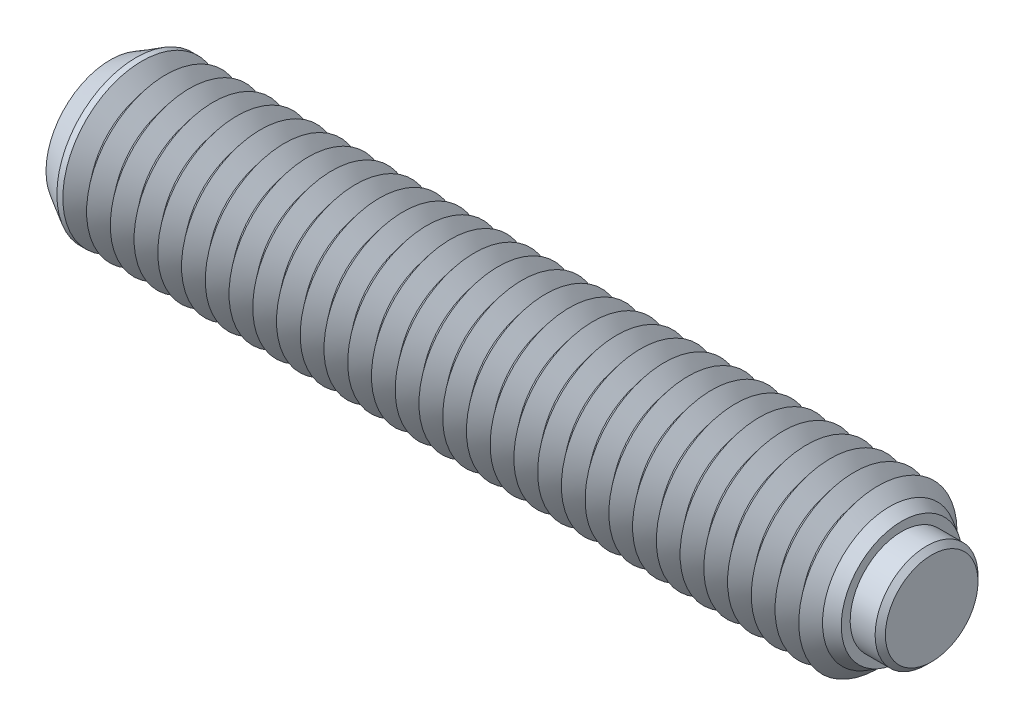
ISO-10303-21;
HEADER;
FILE_DESCRIPTION(('STEP AP214'),'2;1');
FILE_NAME('part.step','',(''),(''),'','','');
FILE_SCHEMA(('AUTOMOTIVE_DESIGN { 1 0 10303 214 1 1 1 1 }'));
ENDSEC;
DATA;
#1=APPLICATION_CONTEXT('core data for automotive mechanical design processes');
#2=APPLICATION_PROTOCOL_DEFINITION('international standard','automotive_design',2000,#1);
#3=PRODUCT_CONTEXT('',#1,'mechanical');
#4=PRODUCT('Part','Part','',(#3));
#5=PRODUCT_RELATED_PRODUCT_CATEGORY('part','',(#4));
#6=PRODUCT_DEFINITION_FORMATION('','',#4);
#7=PRODUCT_DEFINITION_CONTEXT('part definition',#1,'design');
#8=PRODUCT_DEFINITION('design','',#6,#7);
#9=PRODUCT_DEFINITION_SHAPE('','',#8);
#10=(LENGTH_UNIT() NAMED_UNIT(*) SI_UNIT(.MILLI.,.METRE.));
#11=(NAMED_UNIT(*) PLANE_ANGLE_UNIT() SI_UNIT($,.RADIAN.));
#12=(NAMED_UNIT(*) SI_UNIT($,.STERADIAN.) SOLID_ANGLE_UNIT());
#13=UNCERTAINTY_MEASURE_WITH_UNIT(LENGTH_MEASURE(1.E-05),#10,'distance_accuracy_value','');
#14=(GEOMETRIC_REPRESENTATION_CONTEXT(3) GLOBAL_UNCERTAINTY_ASSIGNED_CONTEXT((#13)) GLOBAL_UNIT_ASSIGNED_CONTEXT((#10,
#11,#12)) REPRESENTATION_CONTEXT('',''));
#15=CARTESIAN_POINT('',(0.,0.,0.));
#16=DIRECTION('',(0.,0.,1.));
#17=DIRECTION('',(1.,0.,0.));
#18=AXIS2_PLACEMENT_3D('',#15,#16,#17);
#19=CARTESIAN_POINT('',(2.65,0.,0.));
#20=DIRECTION('',(-1.,0.,0.));
#21=DIRECTION('',(0.,0.,1.));
#22=AXIS2_PLACEMENT_3D('',#19,#20,#21);
#23=CYLINDRICAL_SURFACE('',#22,3.25);
#24=CARTESIAN_POINT('',(2.325,0.,0.));
#25=DIRECTION('',(1.,0.,0.));
#26=DIRECTION('',(0.,0.,-1.));
#27=AXIS2_PLACEMENT_3D('',#24,#25,#26);
#28=CIRCLE('',#27,3.25);
#29=CARTESIAN_POINT('',(2.325,0.,3.25));
#30=VERTEX_POINT('',#29);
#31=EDGE_CURVE('P0_E10',#30,#30,#28,.F.);
#32=CARTESIAN_POINT('',(-1.15,0.,0.));
#33=DIRECTION('',(1.,0.,0.));
#34=DIRECTION('',(0.,0.,-1.));
#35=AXIS2_PLACEMENT_3D('',#32,#33,#34);
#36=CIRCLE('',#35,3.25);
#37=CARTESIAN_POINT('',(-1.15,0.,3.25));
#38=VERTEX_POINT('',#37);
#39=EDGE_CURVE('P0_E25',#38,#38,#36,.T.);
#40=CARTESIAN_POINT('',(2.325,0.,3.25));
#41=CARTESIAN_POINT('',(2.28880208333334,0.,3.25));
#42=CARTESIAN_POINT('',(2.25260416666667,0.,3.25));
#43=CARTESIAN_POINT('',(2.18020833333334,0.,3.25));
#44=CARTESIAN_POINT('',(2.14401041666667,0.,3.25));
#45=CARTESIAN_POINT('',(2.07161458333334,0.,3.25));
#46=CARTESIAN_POINT('',(2.03541666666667,0.,3.25));
#47=CARTESIAN_POINT('',(1.96302083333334,0.,3.25));
#48=CARTESIAN_POINT('',(1.92682291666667,0.,3.25));
#49=CARTESIAN_POINT('',(1.85442708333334,0.,3.25));
#50=CARTESIAN_POINT('',(1.81822916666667,0.,3.25));
#51=CARTESIAN_POINT('',(1.74583333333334,0.,3.25));
#52=CARTESIAN_POINT('',(1.70963541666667,0.,3.25));
#53=CARTESIAN_POINT('',(1.63723958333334,0.,3.25));
#54=CARTESIAN_POINT('',(1.60104166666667,0.,3.25));
#55=CARTESIAN_POINT('',(1.52864583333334,0.,3.25));
#56=CARTESIAN_POINT('',(1.49244791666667,0.,3.25));
#57=CARTESIAN_POINT('',(1.42005208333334,0.,3.25));
#58=CARTESIAN_POINT('',(1.38385416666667,0.,3.25));
#59=CARTESIAN_POINT('',(1.31145833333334,0.,3.25));
#60=CARTESIAN_POINT('',(1.27526041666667,0.,3.25));
#61=CARTESIAN_POINT('',(1.20286458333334,0.,3.25));
#62=CARTESIAN_POINT('',(1.16666666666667,0.,3.25));
#63=CARTESIAN_POINT('',(1.09427083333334,0.,3.25));
#64=CARTESIAN_POINT('',(1.05807291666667,0.,3.25));
#65=CARTESIAN_POINT('',(0.985677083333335,0.,3.25));
#66=CARTESIAN_POINT('',(0.949479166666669,0.,3.25));
#67=CARTESIAN_POINT('',(0.877083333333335,0.,3.25));
#68=CARTESIAN_POINT('',(0.840885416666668,0.,3.25));
#69=CARTESIAN_POINT('',(0.768489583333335,0.,3.25));
#70=CARTESIAN_POINT('',(0.732291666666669,0.,3.25));
#71=CARTESIAN_POINT('',(0.659895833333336,0.,3.25));
#72=CARTESIAN_POINT('',(0.623697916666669,0.,3.25));
#73=CARTESIAN_POINT('',(0.551302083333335,0.,3.25));
#74=CARTESIAN_POINT('',(0.515104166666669,0.,3.25));
#75=CARTESIAN_POINT('',(0.442708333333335,0.,3.25));
#76=CARTESIAN_POINT('',(0.406510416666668,0.,3.25));
#77=CARTESIAN_POINT('',(0.334114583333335,0.,3.25));
#78=CARTESIAN_POINT('',(0.297916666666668,0.,3.25));
#79=CARTESIAN_POINT('',(0.225520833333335,0.,3.25));
#80=CARTESIAN_POINT('',(0.189322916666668,0.,3.25));
#81=CARTESIAN_POINT('',(0.116927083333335,0.,3.25));
#82=CARTESIAN_POINT('',(0.0807291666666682,0.,3.25));
#83=CARTESIAN_POINT('',(0.00833333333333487,0.,3.25));
#84=CARTESIAN_POINT('',(-0.0278645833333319,0.,3.25));
#85=CARTESIAN_POINT('',(-0.100260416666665,0.,3.25));
#86=CARTESIAN_POINT('',(-0.136458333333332,0.,3.25));
#87=CARTESIAN_POINT('',(-0.208854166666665,0.,3.25));
#88=CARTESIAN_POINT('',(-0.245052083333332,0.,3.25));
#89=CARTESIAN_POINT('',(-0.317447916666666,0.,3.25));
#90=CARTESIAN_POINT('',(-0.353645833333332,0.,3.25));
#91=CARTESIAN_POINT('',(-0.426041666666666,0.,3.25));
#92=CARTESIAN_POINT('',(-0.462239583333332,0.,3.25));
#93=CARTESIAN_POINT('',(-0.534635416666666,0.,3.25));
#94=CARTESIAN_POINT('',(-0.570833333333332,0.,3.25));
#95=CARTESIAN_POINT('',(-0.643229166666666,0.,3.25));
#96=CARTESIAN_POINT('',(-0.679427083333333,0.,3.25));
#97=CARTESIAN_POINT('',(-0.751822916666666,0.,3.25));
#98=CARTESIAN_POINT('',(-0.788020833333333,0.,3.25));
#99=CARTESIAN_POINT('',(-0.860416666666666,0.,3.25));
#100=CARTESIAN_POINT('',(-0.896614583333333,0.,3.25));
#101=CARTESIAN_POINT('',(-0.969010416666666,0.,3.25));
#102=CARTESIAN_POINT('',(-1.00520833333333,0.,3.25));
#103=CARTESIAN_POINT('',(-1.07760416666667,0.,3.25));
#104=CARTESIAN_POINT('',(-1.11380208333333,0.,3.25));
#105=CARTESIAN_POINT('',(-1.15,0.,3.25));
#106=B_SPLINE_CURVE_WITH_KNOTS('',3,(#40,#41,#42,#43,#44,#45,#46,#47,#48,#49,#50,#51,#52,#53,
#54,#55,#56,#57,#58,#59,#60,#61,#62,#63,#64,#65,#66,#67,#68,#69,#70,#71,#72,#73,#74,#75,#76,#77,
#78,#79,#80,#81,#82,#83,#84,#85,#86,#87,#88,#89,#90,#91,#92,#93,#94,#95,#96,#97,#98,#99,#100,
#101,#102,#103,#104,#105),.UNSPECIFIED.,.F.,.F.,(4,2,2,2,2,2,2,2,2,2,2,2,2,2,2,2,2,2,2,2,2,2,2,
2,2,2,2,2,2,2,2,2,4),(0.,0.10859375,0.2171875,0.32578125,0.434375,0.54296875,0.6515625,
0.76015625,0.86875,0.977343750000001,1.0859375,1.19453125,1.303125,1.41171875,1.5203125,
1.62890625,1.7375,1.84609375,1.9546875,2.06328125,2.171875,2.28046875,2.3890625,2.49765625,
2.60625,2.71484375,2.8234375,2.93203125,3.040625,3.14921875,3.2578125,3.36640625,3.475),.UNSPECIFIED.);
#107=EDGE_CURVE('P0_BSEAM14',#30,#38,#106,.T.);
#108=ORIENTED_EDGE('',*,*,#31,.T.);
#109=ORIENTED_EDGE('',*,*,#39,.T.);
#110=ORIENTED_EDGE('',*,*,#107,.T.);
#111=ORIENTED_EDGE('',*,*,#107,.F.);
#112=EDGE_LOOP('',(#108,#110,#109,#111));
#113=FACE_BOUND('',#112,.T.);
#114=ADVANCED_FACE('P0_F14',(#113),#23,.T.);
#115=CARTESIAN_POINT('',(2.65,0.,0.));
#116=DIRECTION('',(1.,0.,0.));
#117=DIRECTION('',(0.,0.,-1.));
#118=AXIS2_PLACEMENT_3D('',#115,#116,#117);
#119=PLANE('',#118);
#120=CARTESIAN_POINT('',(2.65,0.,0.));
#121=DIRECTION('',(1.,0.,0.));
#122=DIRECTION('',(0.,0.,-1.));
#123=AXIS2_PLACEMENT_3D('',#120,#121,#122);
#124=CIRCLE('',#123,2.92500000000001);
#125=CARTESIAN_POINT('',(2.65,0.,-2.92500000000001));
#126=VERTEX_POINT('',#125);
#127=EDGE_CURVE('P0_E21',#126,#126,#124,.T.);
#128=ORIENTED_EDGE('',*,*,#127,.T.);
#129=EDGE_LOOP('',(#128));
#130=FACE_BOUND('',#129,.T.);
#131=ADVANCED_FACE('P0_F35',(#130),#119,.T.);
#132=CARTESIAN_POINT('',(-1.15,0.,0.));
#133=DIRECTION('',(1.,0.,0.));
#134=DIRECTION('',(0.,0.,-1.));
#135=AXIS2_PLACEMENT_3D('',#132,#133,#134);
#136=PLANE('',#135);
#137=ORIENTED_EDGE('',*,*,#39,.F.);
#138=EDGE_LOOP('',(#137));
#139=FACE_BOUND('',#138,.T.);
#140=ADVANCED_FACE('P0_F33',(#139),#136,.F.);
#141=CARTESIAN_POINT('',(2.65,0.,0.));
#142=DIRECTION('',(-1.,0.,0.));
#143=DIRECTION('',(0.,0.,1.));
#144=AXIS2_PLACEMENT_3D('',#141,#142,#143);
#145=CONICAL_SURFACE('',#144,2.92500000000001,0.785398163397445);
#146=ORIENTED_EDGE('',*,*,#31,.F.);
#147=EDGE_LOOP('',(#146));
#148=FACE_BOUND('',#147,.T.);
#149=ORIENTED_EDGE('',*,*,#127,.F.);
#150=EDGE_LOOP('',(#149));
#151=FACE_BOUND('',#150,.T.);
#152=ADVANCED_FACE('P0_F16',(#148,#151),#145,.T.);
#153=CLOSED_SHELL('',(#114,#131,#140,#152));
#154=MANIFOLD_SOLID_BREP('P0_B1',#153);
#155=CARTESIAN_POINT('',(-49.25,0.,0.));
#156=DIRECTION('',(1.,0.,0.));
#157=DIRECTION('',(0.,0.,-1.));
#158=AXIS2_PLACEMENT_3D('',#155,#156,#157);
#159=CYLINDRICAL_SURFACE('',#158,5.);
#160=CARTESIAN_POINT('',(-47.25,0.,0.));
#161=DIRECTION('',(1.,0.,0.));
#162=DIRECTION('',(0.,0.,-1.));
#163=AXIS2_PLACEMENT_3D('',#160,#161,#162);
#164=CIRCLE('',#163,5.);
#165=CARTESIAN_POINT('',(-47.25,0.,-5.));
#166=VERTEX_POINT('',#165);
#167=EDGE_CURVE('P1_E226',#166,#166,#164,.T.);
#168=ORIENTED_EDGE('',*,*,#167,.F.);
#169=EDGE_LOOP('',(#168));
#170=FACE_BOUND('',#169,.T.);
#171=CARTESIAN_POINT('',(-47.6275019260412,0.,0.));
#172=DIRECTION('',(1.,0.,0.));
#173=DIRECTION('',(0.,0.,-1.));
#174=AXIS2_PLACEMENT_3D('',#171,#172,#173);
#175=CIRCLE('',#174,5.);
#176=CARTESIAN_POINT('',(-47.6275019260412,0.,-5.));
#177=VERTEX_POINT('',#176);
#178=EDGE_CURVE('P1_E229',#177,#177,#175,.T.);
#179=ORIENTED_EDGE('',*,*,#178,.T.);
#180=EDGE_LOOP('',(#179));
#181=FACE_BOUND('',#180,.T.);
#182=ADVANCED_FACE('P1_F15',(#170,#181),#159,.T.);
#183=CARTESIAN_POINT('',(-1.5,0.,0.));
#184=DIRECTION('',(1.,0.,0.));
#185=DIRECTION('',(0.,0.,-1.));
#186=AXIS2_PLACEMENT_3D('',#183,#184,#185);
#187=CONICAL_SURFACE('',#186,4.06325030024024,0.895664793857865);
#188=CARTESIAN_POINT('',(-0.750000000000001,0.,0.));
#189=DIRECTION('',(1.,0.,0.));
#190=DIRECTION('',(0.,0.,-1.));
#191=AXIS2_PLACEMENT_3D('',#188,#189,#190);
#192=CIRCLE('',#191,5.);
#193=CARTESIAN_POINT('',(-0.750000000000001,0.,-5.));
#194=VERTEX_POINT('',#193);
#195=EDGE_CURVE('P1_E284',#194,#194,#192,.T.);
#196=ORIENTED_EDGE('',*,*,#195,.F.);
#197=EDGE_LOOP('',(#196));
#198=FACE_BOUND('',#197,.T.);
#199=CARTESIAN_POINT('',(-1.5,0.,0.));
#200=DIRECTION('',(1.,0.,0.));
#201=DIRECTION('',(0.,0.,-1.));
#202=AXIS2_PLACEMENT_3D('',#199,#200,#201);
#203=CIRCLE('',#202,4.06325030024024);
#204=CARTESIAN_POINT('',(-1.5,0.,-4.06325030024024));
#205=VERTEX_POINT('',#204);
#206=EDGE_CURVE('P1_E289',#205,#205,#203,.T.);
#207=ORIENTED_EDGE('',*,*,#206,.T.);
#208=EDGE_LOOP('',(#207));
#209=FACE_BOUND('',#208,.T.);
#210=ADVANCED_FACE('P1_F214',(#198,#209),#187,.T.);
#211=CARTESIAN_POINT('',(-2.25,0.,0.));
#212=DIRECTION('',(-1.,0.,0.));
#213=DIRECTION('',(0.,0.,1.));
#214=AXIS2_PLACEMENT_3D('',#211,#212,#213);
#215=CONICAL_SURFACE('',#214,5.,0.895664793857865);
#216=ORIENTED_EDGE('',*,*,#206,.F.);
#217=EDGE_LOOP('',(#216));
#218=FACE_BOUND('',#217,.T.);
#219=CARTESIAN_POINT('',(-2.25,0.,0.));
#220=DIRECTION('',(1.,0.,0.));
#221=DIRECTION('',(0.,0.,-1.));
#222=AXIS2_PLACEMENT_3D('',#219,#220,#221);
#223=CIRCLE('',#222,5.);
#224=CARTESIAN_POINT('',(-2.25,0.,-5.));
#225=VERTEX_POINT('',#224);
#226=EDGE_CURVE('P1_E292',#225,#225,#223,.T.);
#227=ORIENTED_EDGE('',*,*,#226,.T.);
#228=EDGE_LOOP('',(#227));
#229=FACE_BOUND('',#228,.T.);
#230=ADVANCED_FACE('P1_F220',(#218,#229),#215,.T.);
#231=CARTESIAN_POINT('',(-1.15,0.,0.));
#232=DIRECTION('',(1.,0.,0.));
#233=DIRECTION('',(0.,1.,0.));
#234=AXIS2_PLACEMENT_3D('',#231,#232,#233);
#235=PLANE('',#234);
#236=CARTESIAN_POINT('',(-1.15,0.,0.));
#237=DIRECTION('',(1.,0.,0.));
#238=DIRECTION('',(0.,1.,0.));
#239=AXIS2_PLACEMENT_3D('',#236,#237,#238);
#240=CIRCLE('',#239,3.25);
#241=CARTESIAN_POINT('',(-1.15,3.25,0.));
#242=VERTEX_POINT('',#241);
#243=EDGE_CURVE('P1_E279',#242,#242,#240,.T.);
#244=ORIENTED_EDGE('',*,*,#243,.T.);
#245=EDGE_LOOP('',(#244));
#246=FACE_BOUND('',#245,.T.);
#247=ADVANCED_FACE('P1_F717',(#246),#235,.T.);
#248=CARTESIAN_POINT('',(-1.15,0.,0.));
#249=DIRECTION('',(1.,0.,0.));
#250=DIRECTION('',(0.,1.,0.));
#251=AXIS2_PLACEMENT_3D('',#248,#249,#250);
#252=CYLINDRICAL_SURFACE('',#251,3.25);
#253=CARTESIAN_POINT('',(0.75,0.,0.));
#254=DIRECTION('',(1.,0.,0.));
#255=DIRECTION('',(0.,1.,0.));
#256=AXIS2_PLACEMENT_3D('',#253,#254,#255);
#257=CIRCLE('',#256,3.25);
#258=CARTESIAN_POINT('',(0.75,3.25,0.));
#259=VERTEX_POINT('',#258);
#260=EDGE_CURVE('P1_E281',#259,#259,#257,.T.);
#261=CARTESIAN_POINT('',(-1.15,3.25,0.));
#262=CARTESIAN_POINT('',(-1.13020833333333,3.25,0.));
#263=CARTESIAN_POINT('',(-1.11041666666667,3.25,0.));
#264=CARTESIAN_POINT('',(-1.07083333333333,3.25,0.));
#265=CARTESIAN_POINT('',(-1.05104166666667,3.25,0.));
#266=CARTESIAN_POINT('',(-1.01145833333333,3.25,0.));
#267=CARTESIAN_POINT('',(-0.991666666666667,3.25,0.));
#268=CARTESIAN_POINT('',(-0.952083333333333,3.25,0.));
#269=CARTESIAN_POINT('',(-0.932291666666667,3.25,0.));
#270=CARTESIAN_POINT('',(-0.892708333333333,3.25,0.));
#271=CARTESIAN_POINT('',(-0.872916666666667,3.25,0.));
#272=CARTESIAN_POINT('',(-0.833333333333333,3.25,0.));
#273=CARTESIAN_POINT('',(-0.813541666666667,3.25,0.));
#274=CARTESIAN_POINT('',(-0.773958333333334,3.25,0.));
#275=CARTESIAN_POINT('',(-0.754166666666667,3.25,0.));
#276=CARTESIAN_POINT('',(-0.714583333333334,3.25,0.));
#277=CARTESIAN_POINT('',(-0.694791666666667,3.25,0.));
#278=CARTESIAN_POINT('',(-0.655208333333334,3.25,0.));
#279=CARTESIAN_POINT('',(-0.635416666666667,3.25,0.));
#280=CARTESIAN_POINT('',(-0.595833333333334,3.25,0.));
#281=CARTESIAN_POINT('',(-0.576041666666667,3.25,0.));
#282=CARTESIAN_POINT('',(-0.536458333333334,3.25,0.));
#283=CARTESIAN_POINT('',(-0.516666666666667,3.25,0.));
#284=CARTESIAN_POINT('',(-0.477083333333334,3.25,0.));
#285=CARTESIAN_POINT('',(-0.457291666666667,3.25,0.));
#286=CARTESIAN_POINT('',(-0.417708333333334,3.25,0.));
#287=CARTESIAN_POINT('',(-0.397916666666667,3.25,0.));
#288=CARTESIAN_POINT('',(-0.358333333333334,3.25,0.));
#289=CARTESIAN_POINT('',(-0.338541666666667,3.25,0.));
#290=CARTESIAN_POINT('',(-0.298958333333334,3.25,0.));
#291=CARTESIAN_POINT('',(-0.279166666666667,3.25,0.));
#292=CARTESIAN_POINT('',(-0.239583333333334,3.25,0.));
#293=CARTESIAN_POINT('',(-0.219791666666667,3.25,0.));
#294=CARTESIAN_POINT('',(-0.180208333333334,3.25,0.));
#295=CARTESIAN_POINT('',(-0.160416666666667,3.25,0.));
#296=CARTESIAN_POINT('',(-0.120833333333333,3.25,0.));
#297=CARTESIAN_POINT('',(-0.101041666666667,3.25,0.));
#298=CARTESIAN_POINT('',(-0.0614583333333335,3.25,0.));
#299=CARTESIAN_POINT('',(-0.0416666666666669,3.25,0.));
#300=CARTESIAN_POINT('',(-0.00208333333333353,3.25,0.));
#301=CARTESIAN_POINT('',(0.0177083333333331,3.25,0.));
#302=CARTESIAN_POINT('',(0.0572916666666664,3.25,0.));
#303=CARTESIAN_POINT('',(0.0770833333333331,3.25,0.));
#304=CARTESIAN_POINT('',(0.116666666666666,3.25,0.));
#305=CARTESIAN_POINT('',(0.136458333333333,3.25,0.));
#306=CARTESIAN_POINT('',(0.176041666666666,3.25,0.));
#307=CARTESIAN_POINT('',(0.195833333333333,3.25,0.));
#308=CARTESIAN_POINT('',(0.235416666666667,3.25,0.));
#309=CARTESIAN_POINT('',(0.255208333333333,3.25,0.));
#310=CARTESIAN_POINT('',(0.294791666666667,3.25,0.));
#311=CARTESIAN_POINT('',(0.314583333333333,3.25,0.));
#312=CARTESIAN_POINT('',(0.354166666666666,3.25,0.));
#313=CARTESIAN_POINT('',(0.373958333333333,3.25,0.));
#314=CARTESIAN_POINT('',(0.413541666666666,3.25,0.));
#315=CARTESIAN_POINT('',(0.433333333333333,3.25,0.));
#316=CARTESIAN_POINT('',(0.472916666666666,3.25,0.));
#317=CARTESIAN_POINT('',(0.492708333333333,3.25,0.));
#318=CARTESIAN_POINT('',(0.532291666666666,3.25,0.));
#319=CARTESIAN_POINT('',(0.552083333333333,3.25,0.));
#320=CARTESIAN_POINT('',(0.591666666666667,3.25,0.));
#321=CARTESIAN_POINT('',(0.611458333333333,3.25,0.));
#322=CARTESIAN_POINT('',(0.651041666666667,3.25,0.));
#323=CARTESIAN_POINT('',(0.670833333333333,3.25,0.));
#324=CARTESIAN_POINT('',(0.710416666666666,3.25,0.));
#325=CARTESIAN_POINT('',(0.730208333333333,3.25,0.));
#326=CARTESIAN_POINT('',(0.75,3.25,0.));
#327=B_SPLINE_CURVE_WITH_KNOTS('',3,(#261,#262,#263,#264,#265,#266,#267,#268,#269,#270,#271,
#272,#273,#274,#275,#276,#277,#278,#279,#280,#281,#282,#283,#284,#285,#286,#287,#288,#289,#290,
#291,#292,#293,#294,#295,#296,#297,#298,#299,#300,#301,#302,#303,#304,#305,#306,#307,#308,#309,
#310,#311,#312,#313,#314,#315,#316,#317,#318,#319,#320,#321,#322,#323,#324,#325,#326),
.UNSPECIFIED.,.F.,.F.,(4,2,2,2,2,2,2,2,2,2,2,2,2,2,2,2,2,2,2,2,2,2,2,2,2,2,2,2,2,2,2,2,4),(0.,
0.059375,0.11875,0.178125,0.2375,0.296875,0.35625,0.415625,0.475,0.534375,0.59375,0.653125,
0.7125,0.771875,0.83125,0.890625,0.95,1.009375,1.06875,1.128125,1.1875,1.246875,1.30625,
1.365625,1.425,1.484375,1.54375,1.603125,1.6625,1.721875,1.78125,1.840625,1.9),.UNSPECIFIED.);
#328=EDGE_CURVE('P1_BSEAM210',#242,#259,#327,.T.);
#329=ORIENTED_EDGE('',*,*,#243,.F.);
#330=ORIENTED_EDGE('',*,*,#260,.T.);
#331=ORIENTED_EDGE('',*,*,#328,.T.);
#332=ORIENTED_EDGE('',*,*,#328,.F.);
#333=EDGE_LOOP('',(#329,#331,#330,#332));
#334=FACE_BOUND('',#333,.T.);
#335=ADVANCED_FACE('P1_F210',(#334),#252,.F.);
#336=CARTESIAN_POINT('',(0.75,3.81698729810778,0.));
#337=DIRECTION('',(1.,0.,0.));
#338=DIRECTION('',(0.,1.,0.));
#339=AXIS2_PLACEMENT_3D('',#336,#337,#338);
#340=PLANE('',#339);
#341=ORIENTED_EDGE('',*,*,#260,.F.);
#342=EDGE_LOOP('',(#341));
#343=FACE_BOUND('',#342,.T.);
#344=CARTESIAN_POINT('',(0.75,0.,0.));
#345=DIRECTION('',(1.,0.,0.));
#346=DIRECTION('',(0.,1.,0.));
#347=AXIS2_PLACEMENT_3D('',#344,#345,#346);
#348=CIRCLE('',#347,3.81698729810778);
#349=CARTESIAN_POINT('',(0.75,3.81698729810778,0.));
#350=VERTEX_POINT('',#349);
#351=EDGE_CURVE('P1_E121',#350,#350,#348,.T.);
#352=ORIENTED_EDGE('',*,*,#351,.T.);
#353=EDGE_LOOP('',(#352));
#354=FACE_BOUND('',#353,.T.);
#355=ADVANCED_FACE('P1_F206',(#343,#354),#340,.T.);
#356=CARTESIAN_POINT('',(0.75,0.,0.));
#357=DIRECTION('',(-1.,0.,0.));
#358=DIRECTION('',(0.,-1.,0.));
#359=AXIS2_PLACEMENT_3D('',#356,#357,#358);
#360=CONICAL_SURFACE('',#359,3.81698729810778,0.523598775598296);
#361=CARTESIAN_POINT('',(0.,0.,0.));
#362=DIRECTION('',(1.,0.,0.));
#363=DIRECTION('',(0.,0.,-1.));
#364=AXIS2_PLACEMENT_3D('',#361,#362,#363);
#365=CIRCLE('',#364,4.25);
#366=CARTESIAN_POINT('',(0.,0.,-4.25));
#367=VERTEX_POINT('',#366);
#368=EDGE_CURVE('P1_E236',#367,#367,#365,.T.);
#369=ORIENTED_EDGE('',*,*,#368,.T.);
#370=EDGE_LOOP('',(#369));
#371=FACE_BOUND('',#370,.T.);
#372=ORIENTED_EDGE('',*,*,#351,.F.);
#373=EDGE_LOOP('',(#372));
#374=FACE_BOUND('',#373,.T.);
#375=ADVANCED_FACE('P1_F203',(#371,#374),#360,.T.);
#376=CARTESIAN_POINT('',(0.,0.,0.));
#377=DIRECTION('',(-1.,0.,0.));
#378=DIRECTION('',(0.,0.,1.));
#379=AXIS2_PLACEMENT_3D('',#376,#377,#378);
#380=CONICAL_SURFACE('',#379,4.25,0.78539816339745);
#381=ORIENTED_EDGE('',*,*,#195,.T.);
#382=EDGE_LOOP('',(#381));
#383=FACE_BOUND('',#382,.T.);
#384=ORIENTED_EDGE('',*,*,#368,.F.);
#385=EDGE_LOOP('',(#384));
#386=FACE_BOUND('',#385,.T.);
#387=ADVANCED_FACE('P1_F17',(#383,#386),#380,.T.);
#388=CARTESIAN_POINT('',(-3.,0.,0.));
#389=DIRECTION('',(1.,0.,0.));
#390=DIRECTION('',(0.,0.,-1.));
#391=AXIS2_PLACEMENT_3D('',#388,#389,#390);
#392=CONICAL_SURFACE('',#391,4.06325030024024,0.895664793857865);
#393=ORIENTED_EDGE('',*,*,#226,.F.);
#394=EDGE_LOOP('',(#393));
#395=FACE_BOUND('',#394,.T.);
#396=CARTESIAN_POINT('',(-3.,0.,0.));
#397=DIRECTION('',(1.,0.,0.));
#398=DIRECTION('',(0.,0.,-1.));
#399=AXIS2_PLACEMENT_3D('',#396,#397,#398);
#400=CIRCLE('',#399,4.06325030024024);
#401=CARTESIAN_POINT('',(-3.,0.,-4.06325030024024));
#402=VERTEX_POINT('',#401);
#403=EDGE_CURVE('P1_E295',#402,#402,#400,.T.);
#404=ORIENTED_EDGE('',*,*,#403,.T.);
#405=EDGE_LOOP('',(#404));
#406=FACE_BOUND('',#405,.T.);
#407=ADVANCED_FACE('P1_F711',(#395,#406),#392,.T.);
#408=CARTESIAN_POINT('',(-3.75,0.,0.));
#409=DIRECTION('',(-1.,0.,0.));
#410=DIRECTION('',(0.,0.,1.));
#411=AXIS2_PLACEMENT_3D('',#408,#409,#410);
#412=CONICAL_SURFACE('',#411,5.,0.895664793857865);
#413=ORIENTED_EDGE('',*,*,#403,.F.);
#414=EDGE_LOOP('',(#413));
#415=FACE_BOUND('',#414,.T.);
#416=CARTESIAN_POINT('',(-3.75,0.,0.));
#417=DIRECTION('',(1.,0.,0.));
#418=DIRECTION('',(0.,0.,-1.));
#419=AXIS2_PLACEMENT_3D('',#416,#417,#418);
#420=CIRCLE('',#419,5.);
#421=CARTESIAN_POINT('',(-3.75,0.,-5.));
#422=VERTEX_POINT('',#421);
#423=EDGE_CURVE('P1_E298',#422,#422,#420,.T.);
#424=ORIENTED_EDGE('',*,*,#423,.T.);
#425=EDGE_LOOP('',(#424));
#426=FACE_BOUND('',#425,.T.);
#427=ADVANCED_FACE('P1_F707',(#415,#426),#412,.T.);
#428=CARTESIAN_POINT('',(-4.5,0.,0.));
#429=DIRECTION('',(1.,0.,0.));
#430=DIRECTION('',(0.,0.,-1.));
#431=AXIS2_PLACEMENT_3D('',#428,#429,#430);
#432=CONICAL_SURFACE('',#431,4.06325030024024,0.895664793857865);
#433=ORIENTED_EDGE('',*,*,#423,.F.);
#434=EDGE_LOOP('',(#433));
#435=FACE_BOUND('',#434,.T.);
#436=CARTESIAN_POINT('',(-4.5,0.,0.));
#437=DIRECTION('',(1.,0.,0.));
#438=DIRECTION('',(0.,0.,-1.));
#439=AXIS2_PLACEMENT_3D('',#436,#437,#438);
#440=CIRCLE('',#439,4.06325030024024);
#441=CARTESIAN_POINT('',(-4.5,0.,-4.06325030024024));
#442=VERTEX_POINT('',#441);
#443=EDGE_CURVE('P1_E301',#442,#442,#440,.T.);
#444=ORIENTED_EDGE('',*,*,#443,.T.);
#445=EDGE_LOOP('',(#444));
#446=FACE_BOUND('',#445,.T.);
#447=ADVANCED_FACE('P1_F703',(#435,#446),#432,.T.);
#448=CARTESIAN_POINT('',(-5.25,0.,0.));
#449=DIRECTION('',(-1.,0.,0.));
#450=DIRECTION('',(0.,0.,1.));
#451=AXIS2_PLACEMENT_3D('',#448,#449,#450);
#452=CONICAL_SURFACE('',#451,5.,0.895664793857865);
#453=ORIENTED_EDGE('',*,*,#443,.F.);
#454=EDGE_LOOP('',(#453));
#455=FACE_BOUND('',#454,.T.);
#456=CARTESIAN_POINT('',(-5.25,0.,0.));
#457=DIRECTION('',(1.,0.,0.));
#458=DIRECTION('',(0.,0.,-1.));
#459=AXIS2_PLACEMENT_3D('',#456,#457,#458);
#460=CIRCLE('',#459,5.);
#461=CARTESIAN_POINT('',(-5.25,0.,-5.));
#462=VERTEX_POINT('',#461);
#463=EDGE_CURVE('P1_E304',#462,#462,#460,.T.);
#464=ORIENTED_EDGE('',*,*,#463,.T.);
#465=EDGE_LOOP('',(#464));
#466=FACE_BOUND('',#465,.T.);
#467=ADVANCED_FACE('P1_F699',(#455,#466),#452,.T.);
#468=CARTESIAN_POINT('',(-6.,0.,0.));
#469=DIRECTION('',(1.,0.,0.));
#470=DIRECTION('',(0.,0.,-1.));
#471=AXIS2_PLACEMENT_3D('',#468,#469,#470);
#472=CONICAL_SURFACE('',#471,4.06325030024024,0.895664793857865);
#473=ORIENTED_EDGE('',*,*,#463,.F.);
#474=EDGE_LOOP('',(#473));
#475=FACE_BOUND('',#474,.T.);
#476=CARTESIAN_POINT('',(-6.,0.,0.));
#477=DIRECTION('',(1.,0.,0.));
#478=DIRECTION('',(0.,0.,-1.));
#479=AXIS2_PLACEMENT_3D('',#476,#477,#478);
#480=CIRCLE('',#479,4.06325030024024);
#481=CARTESIAN_POINT('',(-6.,0.,-4.06325030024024));
#482=VERTEX_POINT('',#481);
#483=EDGE_CURVE('P1_E307',#482,#482,#480,.T.);
#484=ORIENTED_EDGE('',*,*,#483,.T.);
#485=EDGE_LOOP('',(#484));
#486=FACE_BOUND('',#485,.T.);
#487=ADVANCED_FACE('P1_F695',(#475,#486),#472,.T.);
#488=CARTESIAN_POINT('',(-6.75,0.,0.));
#489=DIRECTION('',(-1.,0.,0.));
#490=DIRECTION('',(0.,0.,1.));
#491=AXIS2_PLACEMENT_3D('',#488,#489,#490);
#492=CONICAL_SURFACE('',#491,5.,0.895664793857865);
#493=ORIENTED_EDGE('',*,*,#483,.F.);
#494=EDGE_LOOP('',(#493));
#495=FACE_BOUND('',#494,.T.);
#496=CARTESIAN_POINT('',(-6.75,0.,0.));
#497=DIRECTION('',(1.,0.,0.));
#498=DIRECTION('',(0.,0.,-1.));
#499=AXIS2_PLACEMENT_3D('',#496,#497,#498);
#500=CIRCLE('',#499,5.);
#501=CARTESIAN_POINT('',(-6.75,0.,-5.));
#502=VERTEX_POINT('',#501);
#503=EDGE_CURVE('P1_E310',#502,#502,#500,.T.);
#504=ORIENTED_EDGE('',*,*,#503,.T.);
#505=EDGE_LOOP('',(#504));
#506=FACE_BOUND('',#505,.T.);
#507=ADVANCED_FACE('P1_F691',(#495,#506),#492,.T.);
#508=CARTESIAN_POINT('',(-7.5,0.,0.));
#509=DIRECTION('',(1.,0.,0.));
#510=DIRECTION('',(0.,0.,-1.));
#511=AXIS2_PLACEMENT_3D('',#508,#509,#510);
#512=CONICAL_SURFACE('',#511,4.06325030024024,0.895664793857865);
#513=ORIENTED_EDGE('',*,*,#503,.F.);
#514=EDGE_LOOP('',(#513));
#515=FACE_BOUND('',#514,.T.);
#516=CARTESIAN_POINT('',(-7.5,0.,0.));
#517=DIRECTION('',(1.,0.,0.));
#518=DIRECTION('',(0.,0.,-1.));
#519=AXIS2_PLACEMENT_3D('',#516,#517,#518);
#520=CIRCLE('',#519,4.06325030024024);
#521=CARTESIAN_POINT('',(-7.5,0.,-4.06325030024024));
#522=VERTEX_POINT('',#521);
#523=EDGE_CURVE('P1_E313',#522,#522,#520,.T.);
#524=ORIENTED_EDGE('',*,*,#523,.T.);
#525=EDGE_LOOP('',(#524));
#526=FACE_BOUND('',#525,.T.);
#527=ADVANCED_FACE('P1_F687',(#515,#526),#512,.T.);
#528=CARTESIAN_POINT('',(-8.25,0.,0.));
#529=DIRECTION('',(-1.,0.,0.));
#530=DIRECTION('',(0.,0.,1.));
#531=AXIS2_PLACEMENT_3D('',#528,#529,#530);
#532=CONICAL_SURFACE('',#531,5.,0.895664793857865);
#533=ORIENTED_EDGE('',*,*,#523,.F.);
#534=EDGE_LOOP('',(#533));
#535=FACE_BOUND('',#534,.T.);
#536=CARTESIAN_POINT('',(-8.25,0.,0.));
#537=DIRECTION('',(1.,0.,0.));
#538=DIRECTION('',(0.,0.,-1.));
#539=AXIS2_PLACEMENT_3D('',#536,#537,#538);
#540=CIRCLE('',#539,5.);
#541=CARTESIAN_POINT('',(-8.25,0.,-5.));
#542=VERTEX_POINT('',#541);
#543=EDGE_CURVE('P1_E316',#542,#542,#540,.T.);
#544=ORIENTED_EDGE('',*,*,#543,.T.);
#545=EDGE_LOOP('',(#544));
#546=FACE_BOUND('',#545,.T.);
#547=ADVANCED_FACE('P1_F683',(#535,#546),#532,.T.);
#548=CARTESIAN_POINT('',(-9.,0.,0.));
#549=DIRECTION('',(1.,0.,0.));
#550=DIRECTION('',(0.,0.,-1.));
#551=AXIS2_PLACEMENT_3D('',#548,#549,#550);
#552=CONICAL_SURFACE('',#551,4.06325030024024,0.895664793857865);
#553=ORIENTED_EDGE('',*,*,#543,.F.);
#554=EDGE_LOOP('',(#553));
#555=FACE_BOUND('',#554,.T.);
#556=CARTESIAN_POINT('',(-9.,0.,0.));
#557=DIRECTION('',(1.,0.,0.));
#558=DIRECTION('',(0.,0.,-1.));
#559=AXIS2_PLACEMENT_3D('',#556,#557,#558);
#560=CIRCLE('',#559,4.06325030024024);
#561=CARTESIAN_POINT('',(-9.,0.,-4.06325030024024));
#562=VERTEX_POINT('',#561);
#563=EDGE_CURVE('P1_E319',#562,#562,#560,.T.);
#564=ORIENTED_EDGE('',*,*,#563,.T.);
#565=EDGE_LOOP('',(#564));
#566=FACE_BOUND('',#565,.T.);
#567=ADVANCED_FACE('P1_F679',(#555,#566),#552,.T.);
#568=CARTESIAN_POINT('',(-9.75,0.,0.));
#569=DIRECTION('',(-1.,0.,0.));
#570=DIRECTION('',(0.,0.,1.));
#571=AXIS2_PLACEMENT_3D('',#568,#569,#570);
#572=CONICAL_SURFACE('',#571,5.,0.895664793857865);
#573=ORIENTED_EDGE('',*,*,#563,.F.);
#574=EDGE_LOOP('',(#573));
#575=FACE_BOUND('',#574,.T.);
#576=CARTESIAN_POINT('',(-9.75,0.,0.));
#577=DIRECTION('',(1.,0.,0.));
#578=DIRECTION('',(0.,0.,-1.));
#579=AXIS2_PLACEMENT_3D('',#576,#577,#578);
#580=CIRCLE('',#579,5.);
#581=CARTESIAN_POINT('',(-9.75,0.,-5.));
#582=VERTEX_POINT('',#581);
#583=EDGE_CURVE('P1_E322',#582,#582,#580,.T.);
#584=ORIENTED_EDGE('',*,*,#583,.T.);
#585=EDGE_LOOP('',(#584));
#586=FACE_BOUND('',#585,.T.);
#587=ADVANCED_FACE('P1_F675',(#575,#586),#572,.T.);
#588=CARTESIAN_POINT('',(-10.5,0.,0.));
#589=DIRECTION('',(1.,0.,0.));
#590=DIRECTION('',(0.,0.,-1.));
#591=AXIS2_PLACEMENT_3D('',#588,#589,#590);
#592=CONICAL_SURFACE('',#591,4.06325030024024,0.895664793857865);
#593=ORIENTED_EDGE('',*,*,#583,.F.);
#594=EDGE_LOOP('',(#593));
#595=FACE_BOUND('',#594,.T.);
#596=CARTESIAN_POINT('',(-10.5,0.,0.));
#597=DIRECTION('',(1.,0.,0.));
#598=DIRECTION('',(0.,0.,-1.));
#599=AXIS2_PLACEMENT_3D('',#596,#597,#598);
#600=CIRCLE('',#599,4.06325030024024);
#601=CARTESIAN_POINT('',(-10.5,0.,-4.06325030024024));
#602=VERTEX_POINT('',#601);
#603=EDGE_CURVE('P1_E325',#602,#602,#600,.T.);
#604=ORIENTED_EDGE('',*,*,#603,.T.);
#605=EDGE_LOOP('',(#604));
#606=FACE_BOUND('',#605,.T.);
#607=ADVANCED_FACE('P1_F671',(#595,#606),#592,.T.);
#608=CARTESIAN_POINT('',(-11.25,0.,0.));
#609=DIRECTION('',(-1.,0.,0.));
#610=DIRECTION('',(0.,0.,1.));
#611=AXIS2_PLACEMENT_3D('',#608,#609,#610);
#612=CONICAL_SURFACE('',#611,5.,0.895664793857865);
#613=ORIENTED_EDGE('',*,*,#603,.F.);
#614=EDGE_LOOP('',(#613));
#615=FACE_BOUND('',#614,.T.);
#616=CARTESIAN_POINT('',(-11.25,0.,0.));
#617=DIRECTION('',(1.,0.,0.));
#618=DIRECTION('',(0.,0.,-1.));
#619=AXIS2_PLACEMENT_3D('',#616,#617,#618);
#620=CIRCLE('',#619,5.);
#621=CARTESIAN_POINT('',(-11.25,0.,-5.));
#622=VERTEX_POINT('',#621);
#623=EDGE_CURVE('P1_E328',#622,#622,#620,.T.);
#624=ORIENTED_EDGE('',*,*,#623,.T.);
#625=EDGE_LOOP('',(#624));
#626=FACE_BOUND('',#625,.T.);
#627=ADVANCED_FACE('P1_F667',(#615,#626),#612,.T.);
#628=CARTESIAN_POINT('',(-12.,0.,0.));
#629=DIRECTION('',(1.,0.,0.));
#630=DIRECTION('',(0.,0.,-1.));
#631=AXIS2_PLACEMENT_3D('',#628,#629,#630);
#632=CONICAL_SURFACE('',#631,4.06325030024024,0.895664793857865);
#633=ORIENTED_EDGE('',*,*,#623,.F.);
#634=EDGE_LOOP('',(#633));
#635=FACE_BOUND('',#634,.T.);
#636=CARTESIAN_POINT('',(-12.,0.,0.));
#637=DIRECTION('',(1.,0.,0.));
#638=DIRECTION('',(0.,0.,-1.));
#639=AXIS2_PLACEMENT_3D('',#636,#637,#638);
#640=CIRCLE('',#639,4.06325030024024);
#641=CARTESIAN_POINT('',(-12.,0.,-4.06325030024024));
#642=VERTEX_POINT('',#641);
#643=EDGE_CURVE('P1_E331',#642,#642,#640,.T.);
#644=ORIENTED_EDGE('',*,*,#643,.T.);
#645=EDGE_LOOP('',(#644));
#646=FACE_BOUND('',#645,.T.);
#647=ADVANCED_FACE('P1_F663',(#635,#646),#632,.T.);
#648=CARTESIAN_POINT('',(-12.75,0.,0.));
#649=DIRECTION('',(-1.,0.,0.));
#650=DIRECTION('',(0.,0.,1.));
#651=AXIS2_PLACEMENT_3D('',#648,#649,#650);
#652=CONICAL_SURFACE('',#651,5.,0.895664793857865);
#653=ORIENTED_EDGE('',*,*,#643,.F.);
#654=EDGE_LOOP('',(#653));
#655=FACE_BOUND('',#654,.T.);
#656=CARTESIAN_POINT('',(-12.75,0.,0.));
#657=DIRECTION('',(1.,0.,0.));
#658=DIRECTION('',(0.,0.,-1.));
#659=AXIS2_PLACEMENT_3D('',#656,#657,#658);
#660=CIRCLE('',#659,5.);
#661=CARTESIAN_POINT('',(-12.75,0.,-5.));
#662=VERTEX_POINT('',#661);
#663=EDGE_CURVE('P1_E334',#662,#662,#660,.T.);
#664=ORIENTED_EDGE('',*,*,#663,.T.);
#665=EDGE_LOOP('',(#664));
#666=FACE_BOUND('',#665,.T.);
#667=ADVANCED_FACE('P1_F659',(#655,#666),#652,.T.);
#668=CARTESIAN_POINT('',(-13.5,0.,0.));
#669=DIRECTION('',(1.,0.,0.));
#670=DIRECTION('',(0.,0.,-1.));
#671=AXIS2_PLACEMENT_3D('',#668,#669,#670);
#672=CONICAL_SURFACE('',#671,4.06325030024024,0.895664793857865);
#673=ORIENTED_EDGE('',*,*,#663,.F.);
#674=EDGE_LOOP('',(#673));
#675=FACE_BOUND('',#674,.T.);
#676=CARTESIAN_POINT('',(-13.5,0.,0.));
#677=DIRECTION('',(1.,0.,0.));
#678=DIRECTION('',(0.,0.,-1.));
#679=AXIS2_PLACEMENT_3D('',#676,#677,#678);
#680=CIRCLE('',#679,4.06325030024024);
#681=CARTESIAN_POINT('',(-13.5,0.,-4.06325030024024));
#682=VERTEX_POINT('',#681);
#683=EDGE_CURVE('P1_E337',#682,#682,#680,.T.);
#684=ORIENTED_EDGE('',*,*,#683,.T.);
#685=EDGE_LOOP('',(#684));
#686=FACE_BOUND('',#685,.T.);
#687=ADVANCED_FACE('P1_F655',(#675,#686),#672,.T.);
#688=CARTESIAN_POINT('',(-14.25,0.,0.));
#689=DIRECTION('',(-1.,0.,0.));
#690=DIRECTION('',(0.,0.,1.));
#691=AXIS2_PLACEMENT_3D('',#688,#689,#690);
#692=CONICAL_SURFACE('',#691,5.,0.895664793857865);
#693=ORIENTED_EDGE('',*,*,#683,.F.);
#694=EDGE_LOOP('',(#693));
#695=FACE_BOUND('',#694,.T.);
#696=CARTESIAN_POINT('',(-14.25,0.,0.));
#697=DIRECTION('',(1.,0.,0.));
#698=DIRECTION('',(0.,0.,-1.));
#699=AXIS2_PLACEMENT_3D('',#696,#697,#698);
#700=CIRCLE('',#699,5.);
#701=CARTESIAN_POINT('',(-14.25,0.,-5.));
#702=VERTEX_POINT('',#701);
#703=EDGE_CURVE('P1_E340',#702,#702,#700,.T.);
#704=ORIENTED_EDGE('',*,*,#703,.T.);
#705=EDGE_LOOP('',(#704));
#706=FACE_BOUND('',#705,.T.);
#707=ADVANCED_FACE('P1_F651',(#695,#706),#692,.T.);
#708=CARTESIAN_POINT('',(-15.,0.,0.));
#709=DIRECTION('',(1.,0.,0.));
#710=DIRECTION('',(0.,0.,-1.));
#711=AXIS2_PLACEMENT_3D('',#708,#709,#710);
#712=CONICAL_SURFACE('',#711,4.06325030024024,0.895664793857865);
#713=ORIENTED_EDGE('',*,*,#703,.F.);
#714=EDGE_LOOP('',(#713));
#715=FACE_BOUND('',#714,.T.);
#716=CARTESIAN_POINT('',(-15.,0.,0.));
#717=DIRECTION('',(1.,0.,0.));
#718=DIRECTION('',(0.,0.,-1.));
#719=AXIS2_PLACEMENT_3D('',#716,#717,#718);
#720=CIRCLE('',#719,4.06325030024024);
#721=CARTESIAN_POINT('',(-15.,0.,-4.06325030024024));
#722=VERTEX_POINT('',#721);
#723=EDGE_CURVE('P1_E343',#722,#722,#720,.T.);
#724=ORIENTED_EDGE('',*,*,#723,.T.);
#725=EDGE_LOOP('',(#724));
#726=FACE_BOUND('',#725,.T.);
#727=ADVANCED_FACE('P1_F647',(#715,#726),#712,.T.);
#728=CARTESIAN_POINT('',(-15.75,0.,0.));
#729=DIRECTION('',(-1.,0.,0.));
#730=DIRECTION('',(0.,0.,1.));
#731=AXIS2_PLACEMENT_3D('',#728,#729,#730);
#732=CONICAL_SURFACE('',#731,5.,0.895664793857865);
#733=ORIENTED_EDGE('',*,*,#723,.F.);
#734=EDGE_LOOP('',(#733));
#735=FACE_BOUND('',#734,.T.);
#736=CARTESIAN_POINT('',(-15.75,0.,0.));
#737=DIRECTION('',(1.,0.,0.));
#738=DIRECTION('',(0.,0.,-1.));
#739=AXIS2_PLACEMENT_3D('',#736,#737,#738);
#740=CIRCLE('',#739,5.);
#741=CARTESIAN_POINT('',(-15.75,0.,-5.));
#742=VERTEX_POINT('',#741);
#743=EDGE_CURVE('P1_E346',#742,#742,#740,.T.);
#744=ORIENTED_EDGE('',*,*,#743,.T.);
#745=EDGE_LOOP('',(#744));
#746=FACE_BOUND('',#745,.T.);
#747=ADVANCED_FACE('P1_F643',(#735,#746),#732,.T.);
#748=CARTESIAN_POINT('',(-16.5,0.,0.));
#749=DIRECTION('',(1.,0.,0.));
#750=DIRECTION('',(0.,0.,-1.));
#751=AXIS2_PLACEMENT_3D('',#748,#749,#750);
#752=CONICAL_SURFACE('',#751,4.06325030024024,0.895664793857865);
#753=ORIENTED_EDGE('',*,*,#743,.F.);
#754=EDGE_LOOP('',(#753));
#755=FACE_BOUND('',#754,.T.);
#756=CARTESIAN_POINT('',(-16.5,0.,0.));
#757=DIRECTION('',(1.,0.,0.));
#758=DIRECTION('',(0.,0.,-1.));
#759=AXIS2_PLACEMENT_3D('',#756,#757,#758);
#760=CIRCLE('',#759,4.06325030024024);
#761=CARTESIAN_POINT('',(-16.5,0.,-4.06325030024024));
#762=VERTEX_POINT('',#761);
#763=EDGE_CURVE('P1_E349',#762,#762,#760,.T.);
#764=ORIENTED_EDGE('',*,*,#763,.T.);
#765=EDGE_LOOP('',(#764));
#766=FACE_BOUND('',#765,.T.);
#767=ADVANCED_FACE('P1_F639',(#755,#766),#752,.T.);
#768=CARTESIAN_POINT('',(-17.25,0.,0.));
#769=DIRECTION('',(-1.,0.,0.));
#770=DIRECTION('',(0.,0.,1.));
#771=AXIS2_PLACEMENT_3D('',#768,#769,#770);
#772=CONICAL_SURFACE('',#771,5.,0.895664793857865);
#773=ORIENTED_EDGE('',*,*,#763,.F.);
#774=EDGE_LOOP('',(#773));
#775=FACE_BOUND('',#774,.T.);
#776=CARTESIAN_POINT('',(-17.25,0.,0.));
#777=DIRECTION('',(1.,0.,0.));
#778=DIRECTION('',(0.,0.,-1.));
#779=AXIS2_PLACEMENT_3D('',#776,#777,#778);
#780=CIRCLE('',#779,5.);
#781=CARTESIAN_POINT('',(-17.25,0.,-5.));
#782=VERTEX_POINT('',#781);
#783=EDGE_CURVE('P1_E352',#782,#782,#780,.T.);
#784=ORIENTED_EDGE('',*,*,#783,.T.);
#785=EDGE_LOOP('',(#784));
#786=FACE_BOUND('',#785,.T.);
#787=ADVANCED_FACE('P1_F635',(#775,#786),#772,.T.);
#788=CARTESIAN_POINT('',(-18.,0.,0.));
#789=DIRECTION('',(1.,0.,0.));
#790=DIRECTION('',(0.,0.,-1.));
#791=AXIS2_PLACEMENT_3D('',#788,#789,#790);
#792=CONICAL_SURFACE('',#791,4.06325030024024,0.895664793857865);
#793=ORIENTED_EDGE('',*,*,#783,.F.);
#794=EDGE_LOOP('',(#793));
#795=FACE_BOUND('',#794,.T.);
#796=CARTESIAN_POINT('',(-18.,0.,0.));
#797=DIRECTION('',(1.,0.,0.));
#798=DIRECTION('',(0.,0.,-1.));
#799=AXIS2_PLACEMENT_3D('',#796,#797,#798);
#800=CIRCLE('',#799,4.06325030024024);
#801=CARTESIAN_POINT('',(-18.,0.,-4.06325030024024));
#802=VERTEX_POINT('',#801);
#803=EDGE_CURVE('P1_E355',#802,#802,#800,.T.);
#804=ORIENTED_EDGE('',*,*,#803,.T.);
#805=EDGE_LOOP('',(#804));
#806=FACE_BOUND('',#805,.T.);
#807=ADVANCED_FACE('P1_F631',(#795,#806),#792,.T.);
#808=CARTESIAN_POINT('',(-18.75,0.,0.));
#809=DIRECTION('',(-1.,0.,0.));
#810=DIRECTION('',(0.,0.,1.));
#811=AXIS2_PLACEMENT_3D('',#808,#809,#810);
#812=CONICAL_SURFACE('',#811,5.,0.895664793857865);
#813=ORIENTED_EDGE('',*,*,#803,.F.);
#814=EDGE_LOOP('',(#813));
#815=FACE_BOUND('',#814,.T.);
#816=CARTESIAN_POINT('',(-18.75,0.,0.));
#817=DIRECTION('',(1.,0.,0.));
#818=DIRECTION('',(0.,0.,-1.));
#819=AXIS2_PLACEMENT_3D('',#816,#817,#818);
#820=CIRCLE('',#819,5.);
#821=CARTESIAN_POINT('',(-18.75,0.,-5.));
#822=VERTEX_POINT('',#821);
#823=EDGE_CURVE('P1_E358',#822,#822,#820,.T.);
#824=ORIENTED_EDGE('',*,*,#823,.T.);
#825=EDGE_LOOP('',(#824));
#826=FACE_BOUND('',#825,.T.);
#827=ADVANCED_FACE('P1_F627',(#815,#826),#812,.T.);
#828=CARTESIAN_POINT('',(-19.5,0.,0.));
#829=DIRECTION('',(1.,0.,0.));
#830=DIRECTION('',(0.,0.,-1.));
#831=AXIS2_PLACEMENT_3D('',#828,#829,#830);
#832=CONICAL_SURFACE('',#831,4.06325030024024,0.895664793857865);
#833=ORIENTED_EDGE('',*,*,#823,.F.);
#834=EDGE_LOOP('',(#833));
#835=FACE_BOUND('',#834,.T.);
#836=CARTESIAN_POINT('',(-19.5,0.,0.));
#837=DIRECTION('',(1.,0.,0.));
#838=DIRECTION('',(0.,0.,-1.));
#839=AXIS2_PLACEMENT_3D('',#836,#837,#838);
#840=CIRCLE('',#839,4.06325030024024);
#841=CARTESIAN_POINT('',(-19.5,0.,-4.06325030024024));
#842=VERTEX_POINT('',#841);
#843=EDGE_CURVE('P1_E361',#842,#842,#840,.T.);
#844=ORIENTED_EDGE('',*,*,#843,.T.);
#845=EDGE_LOOP('',(#844));
#846=FACE_BOUND('',#845,.T.);
#847=ADVANCED_FACE('P1_F623',(#835,#846),#832,.T.);
#848=CARTESIAN_POINT('',(-20.25,0.,0.));
#849=DIRECTION('',(-1.,0.,0.));
#850=DIRECTION('',(0.,0.,1.));
#851=AXIS2_PLACEMENT_3D('',#848,#849,#850);
#852=CONICAL_SURFACE('',#851,5.,0.895664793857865);
#853=ORIENTED_EDGE('',*,*,#843,.F.);
#854=EDGE_LOOP('',(#853));
#855=FACE_BOUND('',#854,.T.);
#856=CARTESIAN_POINT('',(-20.25,0.,0.));
#857=DIRECTION('',(1.,0.,0.));
#858=DIRECTION('',(0.,0.,-1.));
#859=AXIS2_PLACEMENT_3D('',#856,#857,#858);
#860=CIRCLE('',#859,5.);
#861=CARTESIAN_POINT('',(-20.25,0.,-5.));
#862=VERTEX_POINT('',#861);
#863=EDGE_CURVE('P1_E364',#862,#862,#860,.T.);
#864=ORIENTED_EDGE('',*,*,#863,.T.);
#865=EDGE_LOOP('',(#864));
#866=FACE_BOUND('',#865,.T.);
#867=ADVANCED_FACE('P1_F619',(#855,#866),#852,.T.);
#868=CARTESIAN_POINT('',(-21.,0.,0.));
#869=DIRECTION('',(1.,0.,0.));
#870=DIRECTION('',(0.,0.,-1.));
#871=AXIS2_PLACEMENT_3D('',#868,#869,#870);
#872=CONICAL_SURFACE('',#871,4.06325030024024,0.895664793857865);
#873=ORIENTED_EDGE('',*,*,#863,.F.);
#874=EDGE_LOOP('',(#873));
#875=FACE_BOUND('',#874,.T.);
#876=CARTESIAN_POINT('',(-21.,0.,0.));
#877=DIRECTION('',(1.,0.,0.));
#878=DIRECTION('',(0.,0.,-1.));
#879=AXIS2_PLACEMENT_3D('',#876,#877,#878);
#880=CIRCLE('',#879,4.06325030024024);
#881=CARTESIAN_POINT('',(-21.,0.,-4.06325030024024));
#882=VERTEX_POINT('',#881);
#883=EDGE_CURVE('P1_E367',#882,#882,#880,.T.);
#884=ORIENTED_EDGE('',*,*,#883,.T.);
#885=EDGE_LOOP('',(#884));
#886=FACE_BOUND('',#885,.T.);
#887=ADVANCED_FACE('P1_F615',(#875,#886),#872,.T.);
#888=CARTESIAN_POINT('',(-21.75,0.,0.));
#889=DIRECTION('',(-1.,0.,0.));
#890=DIRECTION('',(0.,0.,1.));
#891=AXIS2_PLACEMENT_3D('',#888,#889,#890);
#892=CONICAL_SURFACE('',#891,5.,0.895664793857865);
#893=ORIENTED_EDGE('',*,*,#883,.F.);
#894=EDGE_LOOP('',(#893));
#895=FACE_BOUND('',#894,.T.);
#896=CARTESIAN_POINT('',(-21.75,0.,0.));
#897=DIRECTION('',(1.,0.,0.));
#898=DIRECTION('',(0.,0.,-1.));
#899=AXIS2_PLACEMENT_3D('',#896,#897,#898);
#900=CIRCLE('',#899,5.);
#901=CARTESIAN_POINT('',(-21.75,0.,-5.));
#902=VERTEX_POINT('',#901);
#903=EDGE_CURVE('P1_E370',#902,#902,#900,.T.);
#904=ORIENTED_EDGE('',*,*,#903,.T.);
#905=EDGE_LOOP('',(#904));
#906=FACE_BOUND('',#905,.T.);
#907=ADVANCED_FACE('P1_F611',(#895,#906),#892,.T.);
#908=CARTESIAN_POINT('',(-22.5,0.,0.));
#909=DIRECTION('',(1.,0.,0.));
#910=DIRECTION('',(0.,0.,-1.));
#911=AXIS2_PLACEMENT_3D('',#908,#909,#910);
#912=CONICAL_SURFACE('',#911,4.06325030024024,0.895664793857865);
#913=ORIENTED_EDGE('',*,*,#903,.F.);
#914=EDGE_LOOP('',(#913));
#915=FACE_BOUND('',#914,.T.);
#916=CARTESIAN_POINT('',(-22.5,0.,0.));
#917=DIRECTION('',(1.,0.,0.));
#918=DIRECTION('',(0.,0.,-1.));
#919=AXIS2_PLACEMENT_3D('',#916,#917,#918);
#920=CIRCLE('',#919,4.06325030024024);
#921=CARTESIAN_POINT('',(-22.5,0.,-4.06325030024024));
#922=VERTEX_POINT('',#921);
#923=EDGE_CURVE('P1_E373',#922,#922,#920,.T.);
#924=ORIENTED_EDGE('',*,*,#923,.T.);
#925=EDGE_LOOP('',(#924));
#926=FACE_BOUND('',#925,.T.);
#927=ADVANCED_FACE('P1_F607',(#915,#926),#912,.T.);
#928=CARTESIAN_POINT('',(-23.25,0.,0.));
#929=DIRECTION('',(-1.,0.,0.));
#930=DIRECTION('',(0.,0.,1.));
#931=AXIS2_PLACEMENT_3D('',#928,#929,#930);
#932=CONICAL_SURFACE('',#931,5.,0.895664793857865);
#933=ORIENTED_EDGE('',*,*,#923,.F.);
#934=EDGE_LOOP('',(#933));
#935=FACE_BOUND('',#934,.T.);
#936=CARTESIAN_POINT('',(-23.25,0.,0.));
#937=DIRECTION('',(1.,0.,0.));
#938=DIRECTION('',(0.,0.,-1.));
#939=AXIS2_PLACEMENT_3D('',#936,#937,#938);
#940=CIRCLE('',#939,5.);
#941=CARTESIAN_POINT('',(-23.25,0.,-5.));
#942=VERTEX_POINT('',#941);
#943=EDGE_CURVE('P1_E376',#942,#942,#940,.T.);
#944=ORIENTED_EDGE('',*,*,#943,.T.);
#945=EDGE_LOOP('',(#944));
#946=FACE_BOUND('',#945,.T.);
#947=ADVANCED_FACE('P1_F603',(#935,#946),#932,.T.);
#948=CARTESIAN_POINT('',(-24.,0.,0.));
#949=DIRECTION('',(1.,0.,0.));
#950=DIRECTION('',(0.,0.,-1.));
#951=AXIS2_PLACEMENT_3D('',#948,#949,#950);
#952=CONICAL_SURFACE('',#951,4.06325030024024,0.895664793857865);
#953=ORIENTED_EDGE('',*,*,#943,.F.);
#954=EDGE_LOOP('',(#953));
#955=FACE_BOUND('',#954,.T.);
#956=CARTESIAN_POINT('',(-24.,0.,0.));
#957=DIRECTION('',(1.,0.,0.));
#958=DIRECTION('',(0.,0.,-1.));
#959=AXIS2_PLACEMENT_3D('',#956,#957,#958);
#960=CIRCLE('',#959,4.06325030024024);
#961=CARTESIAN_POINT('',(-24.,0.,-4.06325030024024));
#962=VERTEX_POINT('',#961);
#963=EDGE_CURVE('P1_E379',#962,#962,#960,.T.);
#964=ORIENTED_EDGE('',*,*,#963,.T.);
#965=EDGE_LOOP('',(#964));
#966=FACE_BOUND('',#965,.T.);
#967=ADVANCED_FACE('P1_F599',(#955,#966),#952,.T.);
#968=CARTESIAN_POINT('',(-24.75,0.,0.));
#969=DIRECTION('',(-1.,0.,0.));
#970=DIRECTION('',(0.,0.,1.));
#971=AXIS2_PLACEMENT_3D('',#968,#969,#970);
#972=CONICAL_SURFACE('',#971,5.,0.895664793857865);
#973=ORIENTED_EDGE('',*,*,#963,.F.);
#974=EDGE_LOOP('',(#973));
#975=FACE_BOUND('',#974,.T.);
#976=CARTESIAN_POINT('',(-24.75,0.,0.));
#977=DIRECTION('',(1.,0.,0.));
#978=DIRECTION('',(0.,0.,-1.));
#979=AXIS2_PLACEMENT_3D('',#976,#977,#978);
#980=CIRCLE('',#979,5.);
#981=CARTESIAN_POINT('',(-24.75,0.,-5.));
#982=VERTEX_POINT('',#981);
#983=EDGE_CURVE('P1_E382',#982,#982,#980,.T.);
#984=ORIENTED_EDGE('',*,*,#983,.T.);
#985=EDGE_LOOP('',(#984));
#986=FACE_BOUND('',#985,.T.);
#987=ADVANCED_FACE('P1_F595',(#975,#986),#972,.T.);
#988=CARTESIAN_POINT('',(-25.5,0.,0.));
#989=DIRECTION('',(1.,0.,0.));
#990=DIRECTION('',(0.,0.,-1.));
#991=AXIS2_PLACEMENT_3D('',#988,#989,#990);
#992=CONICAL_SURFACE('',#991,4.06325030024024,0.895664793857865);
#993=ORIENTED_EDGE('',*,*,#983,.F.);
#994=EDGE_LOOP('',(#993));
#995=FACE_BOUND('',#994,.T.);
#996=CARTESIAN_POINT('',(-25.5,0.,0.));
#997=DIRECTION('',(1.,0.,0.));
#998=DIRECTION('',(0.,0.,-1.));
#999=AXIS2_PLACEMENT_3D('',#996,#997,#998);
#1000=CIRCLE('',#999,4.06325030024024);
#1001=CARTESIAN_POINT('',(-25.5,0.,-4.06325030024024));
#1002=VERTEX_POINT('',#1001);
#1003=EDGE_CURVE('P1_E385',#1002,#1002,#1000,.T.);
#1004=ORIENTED_EDGE('',*,*,#1003,.T.);
#1005=EDGE_LOOP('',(#1004));
#1006=FACE_BOUND('',#1005,.T.);
#1007=ADVANCED_FACE('P1_F591',(#995,#1006),#992,.T.);
#1008=CARTESIAN_POINT('',(-26.25,0.,0.));
#1009=DIRECTION('',(-1.,0.,0.));
#1010=DIRECTION('',(0.,0.,1.));
#1011=AXIS2_PLACEMENT_3D('',#1008,#1009,#1010);
#1012=CONICAL_SURFACE('',#1011,5.,0.895664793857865);
#1013=ORIENTED_EDGE('',*,*,#1003,.F.);
#1014=EDGE_LOOP('',(#1013));
#1015=FACE_BOUND('',#1014,.T.);
#1016=CARTESIAN_POINT('',(-26.25,0.,0.));
#1017=DIRECTION('',(1.,0.,0.));
#1018=DIRECTION('',(0.,0.,-1.));
#1019=AXIS2_PLACEMENT_3D('',#1016,#1017,#1018);
#1020=CIRCLE('',#1019,5.);
#1021=CARTESIAN_POINT('',(-26.25,0.,-5.));
#1022=VERTEX_POINT('',#1021);
#1023=EDGE_CURVE('P1_E388',#1022,#1022,#1020,.T.);
#1024=ORIENTED_EDGE('',*,*,#1023,.T.);
#1025=EDGE_LOOP('',(#1024));
#1026=FACE_BOUND('',#1025,.T.);
#1027=ADVANCED_FACE('P1_F587',(#1015,#1026),#1012,.T.);
#1028=CARTESIAN_POINT('',(-27.,0.,0.));
#1029=DIRECTION('',(1.,0.,0.));
#1030=DIRECTION('',(0.,0.,-1.));
#1031=AXIS2_PLACEMENT_3D('',#1028,#1029,#1030);
#1032=CONICAL_SURFACE('',#1031,4.06325030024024,0.895664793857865);
#1033=ORIENTED_EDGE('',*,*,#1023,.F.);
#1034=EDGE_LOOP('',(#1033));
#1035=FACE_BOUND('',#1034,.T.);
#1036=CARTESIAN_POINT('',(-27.,0.,0.));
#1037=DIRECTION('',(1.,0.,0.));
#1038=DIRECTION('',(0.,0.,-1.));
#1039=AXIS2_PLACEMENT_3D('',#1036,#1037,#1038);
#1040=CIRCLE('',#1039,4.06325030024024);
#1041=CARTESIAN_POINT('',(-27.,0.,-4.06325030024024));
#1042=VERTEX_POINT('',#1041);
#1043=EDGE_CURVE('P1_E391',#1042,#1042,#1040,.T.);
#1044=ORIENTED_EDGE('',*,*,#1043,.T.);
#1045=EDGE_LOOP('',(#1044));
#1046=FACE_BOUND('',#1045,.T.);
#1047=ADVANCED_FACE('P1_F583',(#1035,#1046),#1032,.T.);
#1048=CARTESIAN_POINT('',(-27.75,0.,0.));
#1049=DIRECTION('',(-1.,0.,0.));
#1050=DIRECTION('',(0.,0.,1.));
#1051=AXIS2_PLACEMENT_3D('',#1048,#1049,#1050);
#1052=CONICAL_SURFACE('',#1051,5.,0.895664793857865);
#1053=ORIENTED_EDGE('',*,*,#1043,.F.);
#1054=EDGE_LOOP('',(#1053));
#1055=FACE_BOUND('',#1054,.T.);
#1056=CARTESIAN_POINT('',(-27.75,0.,0.));
#1057=DIRECTION('',(1.,0.,0.));
#1058=DIRECTION('',(0.,0.,-1.));
#1059=AXIS2_PLACEMENT_3D('',#1056,#1057,#1058);
#1060=CIRCLE('',#1059,5.);
#1061=CARTESIAN_POINT('',(-27.75,0.,-5.));
#1062=VERTEX_POINT('',#1061);
#1063=EDGE_CURVE('P1_E394',#1062,#1062,#1060,.T.);
#1064=ORIENTED_EDGE('',*,*,#1063,.T.);
#1065=EDGE_LOOP('',(#1064));
#1066=FACE_BOUND('',#1065,.T.);
#1067=ADVANCED_FACE('P1_F579',(#1055,#1066),#1052,.T.);
#1068=CARTESIAN_POINT('',(-28.5,0.,0.));
#1069=DIRECTION('',(1.,0.,0.));
#1070=DIRECTION('',(0.,0.,-1.));
#1071=AXIS2_PLACEMENT_3D('',#1068,#1069,#1070);
#1072=CONICAL_SURFACE('',#1071,4.06325030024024,0.895664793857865);
#1073=ORIENTED_EDGE('',*,*,#1063,.F.);
#1074=EDGE_LOOP('',(#1073));
#1075=FACE_BOUND('',#1074,.T.);
#1076=CARTESIAN_POINT('',(-28.5,0.,0.));
#1077=DIRECTION('',(1.,0.,0.));
#1078=DIRECTION('',(0.,0.,-1.));
#1079=AXIS2_PLACEMENT_3D('',#1076,#1077,#1078);
#1080=CIRCLE('',#1079,4.06325030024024);
#1081=CARTESIAN_POINT('',(-28.5,0.,-4.06325030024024));
#1082=VERTEX_POINT('',#1081);
#1083=EDGE_CURVE('P1_E397',#1082,#1082,#1080,.T.);
#1084=ORIENTED_EDGE('',*,*,#1083,.T.);
#1085=EDGE_LOOP('',(#1084));
#1086=FACE_BOUND('',#1085,.T.);
#1087=ADVANCED_FACE('P1_F575',(#1075,#1086),#1072,.T.);
#1088=CARTESIAN_POINT('',(-29.25,0.,0.));
#1089=DIRECTION('',(-1.,0.,0.));
#1090=DIRECTION('',(0.,0.,1.));
#1091=AXIS2_PLACEMENT_3D('',#1088,#1089,#1090);
#1092=CONICAL_SURFACE('',#1091,5.,0.895664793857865);
#1093=ORIENTED_EDGE('',*,*,#1083,.F.);
#1094=EDGE_LOOP('',(#1093));
#1095=FACE_BOUND('',#1094,.T.);
#1096=CARTESIAN_POINT('',(-29.25,0.,0.));
#1097=DIRECTION('',(1.,0.,0.));
#1098=DIRECTION('',(0.,0.,-1.));
#1099=AXIS2_PLACEMENT_3D('',#1096,#1097,#1098);
#1100=CIRCLE('',#1099,5.);
#1101=CARTESIAN_POINT('',(-29.25,0.,-5.));
#1102=VERTEX_POINT('',#1101);
#1103=EDGE_CURVE('P1_E400',#1102,#1102,#1100,.T.);
#1104=ORIENTED_EDGE('',*,*,#1103,.T.);
#1105=EDGE_LOOP('',(#1104));
#1106=FACE_BOUND('',#1105,.T.);
#1107=ADVANCED_FACE('P1_F571',(#1095,#1106),#1092,.T.);
#1108=CARTESIAN_POINT('',(-30.,0.,0.));
#1109=DIRECTION('',(1.,0.,0.));
#1110=DIRECTION('',(0.,0.,-1.));
#1111=AXIS2_PLACEMENT_3D('',#1108,#1109,#1110);
#1112=CONICAL_SURFACE('',#1111,4.06325030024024,0.895664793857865);
#1113=ORIENTED_EDGE('',*,*,#1103,.F.);
#1114=EDGE_LOOP('',(#1113));
#1115=FACE_BOUND('',#1114,.T.);
#1116=CARTESIAN_POINT('',(-30.,0.,0.));
#1117=DIRECTION('',(1.,0.,0.));
#1118=DIRECTION('',(0.,0.,-1.));
#1119=AXIS2_PLACEMENT_3D('',#1116,#1117,#1118);
#1120=CIRCLE('',#1119,4.06325030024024);
#1121=CARTESIAN_POINT('',(-30.,0.,-4.06325030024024));
#1122=VERTEX_POINT('',#1121);
#1123=EDGE_CURVE('P1_E403',#1122,#1122,#1120,.T.);
#1124=ORIENTED_EDGE('',*,*,#1123,.T.);
#1125=EDGE_LOOP('',(#1124));
#1126=FACE_BOUND('',#1125,.T.);
#1127=ADVANCED_FACE('P1_F567',(#1115,#1126),#1112,.T.);
#1128=CARTESIAN_POINT('',(-30.75,0.,0.));
#1129=DIRECTION('',(-1.,0.,0.));
#1130=DIRECTION('',(0.,0.,1.));
#1131=AXIS2_PLACEMENT_3D('',#1128,#1129,#1130);
#1132=CONICAL_SURFACE('',#1131,5.,0.895664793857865);
#1133=ORIENTED_EDGE('',*,*,#1123,.F.);
#1134=EDGE_LOOP('',(#1133));
#1135=FACE_BOUND('',#1134,.T.);
#1136=CARTESIAN_POINT('',(-30.75,0.,0.));
#1137=DIRECTION('',(1.,0.,0.));
#1138=DIRECTION('',(0.,0.,-1.));
#1139=AXIS2_PLACEMENT_3D('',#1136,#1137,#1138);
#1140=CIRCLE('',#1139,5.);
#1141=CARTESIAN_POINT('',(-30.75,0.,-5.));
#1142=VERTEX_POINT('',#1141);
#1143=EDGE_CURVE('P1_E406',#1142,#1142,#1140,.T.);
#1144=ORIENTED_EDGE('',*,*,#1143,.T.);
#1145=EDGE_LOOP('',(#1144));
#1146=FACE_BOUND('',#1145,.T.);
#1147=ADVANCED_FACE('P1_F563',(#1135,#1146),#1132,.T.);
#1148=CARTESIAN_POINT('',(-31.5,0.,0.));
#1149=DIRECTION('',(1.,0.,0.));
#1150=DIRECTION('',(0.,0.,-1.));
#1151=AXIS2_PLACEMENT_3D('',#1148,#1149,#1150);
#1152=CONICAL_SURFACE('',#1151,4.06325030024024,0.895664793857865);
#1153=ORIENTED_EDGE('',*,*,#1143,.F.);
#1154=EDGE_LOOP('',(#1153));
#1155=FACE_BOUND('',#1154,.T.);
#1156=CARTESIAN_POINT('',(-31.5,0.,0.));
#1157=DIRECTION('',(1.,0.,0.));
#1158=DIRECTION('',(0.,0.,-1.));
#1159=AXIS2_PLACEMENT_3D('',#1156,#1157,#1158);
#1160=CIRCLE('',#1159,4.06325030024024);
#1161=CARTESIAN_POINT('',(-31.5,0.,-4.06325030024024));
#1162=VERTEX_POINT('',#1161);
#1163=EDGE_CURVE('P1_E409',#1162,#1162,#1160,.T.);
#1164=ORIENTED_EDGE('',*,*,#1163,.T.);
#1165=EDGE_LOOP('',(#1164));
#1166=FACE_BOUND('',#1165,.T.);
#1167=ADVANCED_FACE('P1_F559',(#1155,#1166),#1152,.T.);
#1168=CARTESIAN_POINT('',(-32.25,0.,0.));
#1169=DIRECTION('',(-1.,0.,0.));
#1170=DIRECTION('',(0.,0.,1.));
#1171=AXIS2_PLACEMENT_3D('',#1168,#1169,#1170);
#1172=CONICAL_SURFACE('',#1171,5.,0.895664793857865);
#1173=ORIENTED_EDGE('',*,*,#1163,.F.);
#1174=EDGE_LOOP('',(#1173));
#1175=FACE_BOUND('',#1174,.T.);
#1176=CARTESIAN_POINT('',(-32.25,0.,0.));
#1177=DIRECTION('',(1.,0.,0.));
#1178=DIRECTION('',(0.,0.,-1.));
#1179=AXIS2_PLACEMENT_3D('',#1176,#1177,#1178);
#1180=CIRCLE('',#1179,5.);
#1181=CARTESIAN_POINT('',(-32.25,0.,-5.));
#1182=VERTEX_POINT('',#1181);
#1183=EDGE_CURVE('P1_E412',#1182,#1182,#1180,.T.);
#1184=ORIENTED_EDGE('',*,*,#1183,.T.);
#1185=EDGE_LOOP('',(#1184));
#1186=FACE_BOUND('',#1185,.T.);
#1187=ADVANCED_FACE('P1_F555',(#1175,#1186),#1172,.T.);
#1188=CARTESIAN_POINT('',(-33.,0.,0.));
#1189=DIRECTION('',(1.,0.,0.));
#1190=DIRECTION('',(0.,0.,-1.));
#1191=AXIS2_PLACEMENT_3D('',#1188,#1189,#1190);
#1192=CONICAL_SURFACE('',#1191,4.06325030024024,0.895664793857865);
#1193=ORIENTED_EDGE('',*,*,#1183,.F.);
#1194=EDGE_LOOP('',(#1193));
#1195=FACE_BOUND('',#1194,.T.);
#1196=CARTESIAN_POINT('',(-33.,0.,0.));
#1197=DIRECTION('',(1.,0.,0.));
#1198=DIRECTION('',(0.,0.,-1.));
#1199=AXIS2_PLACEMENT_3D('',#1196,#1197,#1198);
#1200=CIRCLE('',#1199,4.06325030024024);
#1201=CARTESIAN_POINT('',(-33.,0.,-4.06325030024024));
#1202=VERTEX_POINT('',#1201);
#1203=EDGE_CURVE('P1_E415',#1202,#1202,#1200,.T.);
#1204=ORIENTED_EDGE('',*,*,#1203,.T.);
#1205=EDGE_LOOP('',(#1204));
#1206=FACE_BOUND('',#1205,.T.);
#1207=ADVANCED_FACE('P1_F551',(#1195,#1206),#1192,.T.);
#1208=CARTESIAN_POINT('',(-33.75,0.,0.));
#1209=DIRECTION('',(-1.,0.,0.));
#1210=DIRECTION('',(0.,0.,1.));
#1211=AXIS2_PLACEMENT_3D('',#1208,#1209,#1210);
#1212=CONICAL_SURFACE('',#1211,5.,0.895664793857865);
#1213=ORIENTED_EDGE('',*,*,#1203,.F.);
#1214=EDGE_LOOP('',(#1213));
#1215=FACE_BOUND('',#1214,.T.);
#1216=CARTESIAN_POINT('',(-33.75,0.,0.));
#1217=DIRECTION('',(1.,0.,0.));
#1218=DIRECTION('',(0.,0.,-1.));
#1219=AXIS2_PLACEMENT_3D('',#1216,#1217,#1218);
#1220=CIRCLE('',#1219,5.);
#1221=CARTESIAN_POINT('',(-33.75,0.,-5.));
#1222=VERTEX_POINT('',#1221);
#1223=EDGE_CURVE('P1_E418',#1222,#1222,#1220,.T.);
#1224=ORIENTED_EDGE('',*,*,#1223,.T.);
#1225=EDGE_LOOP('',(#1224));
#1226=FACE_BOUND('',#1225,.T.);
#1227=ADVANCED_FACE('P1_F547',(#1215,#1226),#1212,.T.);
#1228=CARTESIAN_POINT('',(-34.5,0.,0.));
#1229=DIRECTION('',(1.,0.,0.));
#1230=DIRECTION('',(0.,0.,-1.));
#1231=AXIS2_PLACEMENT_3D('',#1228,#1229,#1230);
#1232=CONICAL_SURFACE('',#1231,4.06325030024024,0.895664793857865);
#1233=ORIENTED_EDGE('',*,*,#1223,.F.);
#1234=EDGE_LOOP('',(#1233));
#1235=FACE_BOUND('',#1234,.T.);
#1236=CARTESIAN_POINT('',(-34.5,0.,0.));
#1237=DIRECTION('',(1.,0.,0.));
#1238=DIRECTION('',(0.,0.,-1.));
#1239=AXIS2_PLACEMENT_3D('',#1236,#1237,#1238);
#1240=CIRCLE('',#1239,4.06325030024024);
#1241=CARTESIAN_POINT('',(-34.5,0.,-4.06325030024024));
#1242=VERTEX_POINT('',#1241);
#1243=EDGE_CURVE('P1_E421',#1242,#1242,#1240,.T.);
#1244=ORIENTED_EDGE('',*,*,#1243,.T.);
#1245=EDGE_LOOP('',(#1244));
#1246=FACE_BOUND('',#1245,.T.);
#1247=ADVANCED_FACE('P1_F543',(#1235,#1246),#1232,.T.);
#1248=CARTESIAN_POINT('',(-35.25,0.,0.));
#1249=DIRECTION('',(-1.,0.,0.));
#1250=DIRECTION('',(0.,0.,1.));
#1251=AXIS2_PLACEMENT_3D('',#1248,#1249,#1250);
#1252=CONICAL_SURFACE('',#1251,5.,0.895664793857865);
#1253=ORIENTED_EDGE('',*,*,#1243,.F.);
#1254=EDGE_LOOP('',(#1253));
#1255=FACE_BOUND('',#1254,.T.);
#1256=CARTESIAN_POINT('',(-35.25,0.,0.));
#1257=DIRECTION('',(1.,0.,0.));
#1258=DIRECTION('',(0.,0.,-1.));
#1259=AXIS2_PLACEMENT_3D('',#1256,#1257,#1258);
#1260=CIRCLE('',#1259,5.);
#1261=CARTESIAN_POINT('',(-35.25,0.,-5.));
#1262=VERTEX_POINT('',#1261);
#1263=EDGE_CURVE('P1_E424',#1262,#1262,#1260,.T.);
#1264=ORIENTED_EDGE('',*,*,#1263,.T.);
#1265=EDGE_LOOP('',(#1264));
#1266=FACE_BOUND('',#1265,.T.);
#1267=ADVANCED_FACE('P1_F539',(#1255,#1266),#1252,.T.);
#1268=CARTESIAN_POINT('',(-36.,0.,0.));
#1269=DIRECTION('',(1.,0.,0.));
#1270=DIRECTION('',(0.,0.,-1.));
#1271=AXIS2_PLACEMENT_3D('',#1268,#1269,#1270);
#1272=CONICAL_SURFACE('',#1271,4.06325030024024,0.895664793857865);
#1273=ORIENTED_EDGE('',*,*,#1263,.F.);
#1274=EDGE_LOOP('',(#1273));
#1275=FACE_BOUND('',#1274,.T.);
#1276=CARTESIAN_POINT('',(-36.,0.,0.));
#1277=DIRECTION('',(1.,0.,0.));
#1278=DIRECTION('',(0.,0.,-1.));
#1279=AXIS2_PLACEMENT_3D('',#1276,#1277,#1278);
#1280=CIRCLE('',#1279,4.06325030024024);
#1281=CARTESIAN_POINT('',(-36.,0.,-4.06325030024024));
#1282=VERTEX_POINT('',#1281);
#1283=EDGE_CURVE('P1_E427',#1282,#1282,#1280,.T.);
#1284=ORIENTED_EDGE('',*,*,#1283,.T.);
#1285=EDGE_LOOP('',(#1284));
#1286=FACE_BOUND('',#1285,.T.);
#1287=ADVANCED_FACE('P1_F535',(#1275,#1286),#1272,.T.);
#1288=CARTESIAN_POINT('',(-36.75,0.,0.));
#1289=DIRECTION('',(-1.,0.,0.));
#1290=DIRECTION('',(0.,0.,1.));
#1291=AXIS2_PLACEMENT_3D('',#1288,#1289,#1290);
#1292=CONICAL_SURFACE('',#1291,5.,0.895664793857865);
#1293=ORIENTED_EDGE('',*,*,#1283,.F.);
#1294=EDGE_LOOP('',(#1293));
#1295=FACE_BOUND('',#1294,.T.);
#1296=CARTESIAN_POINT('',(-36.75,0.,0.));
#1297=DIRECTION('',(1.,0.,0.));
#1298=DIRECTION('',(0.,0.,-1.));
#1299=AXIS2_PLACEMENT_3D('',#1296,#1297,#1298);
#1300=CIRCLE('',#1299,5.);
#1301=CARTESIAN_POINT('',(-36.75,0.,-5.));
#1302=VERTEX_POINT('',#1301);
#1303=EDGE_CURVE('P1_E430',#1302,#1302,#1300,.T.);
#1304=ORIENTED_EDGE('',*,*,#1303,.T.);
#1305=EDGE_LOOP('',(#1304));
#1306=FACE_BOUND('',#1305,.T.);
#1307=ADVANCED_FACE('P1_F531',(#1295,#1306),#1292,.T.);
#1308=CARTESIAN_POINT('',(-37.5,0.,0.));
#1309=DIRECTION('',(1.,0.,0.));
#1310=DIRECTION('',(0.,0.,-1.));
#1311=AXIS2_PLACEMENT_3D('',#1308,#1309,#1310);
#1312=CONICAL_SURFACE('',#1311,4.06325030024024,0.895664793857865);
#1313=ORIENTED_EDGE('',*,*,#1303,.F.);
#1314=EDGE_LOOP('',(#1313));
#1315=FACE_BOUND('',#1314,.T.);
#1316=CARTESIAN_POINT('',(-37.5,0.,0.));
#1317=DIRECTION('',(1.,0.,0.));
#1318=DIRECTION('',(0.,0.,-1.));
#1319=AXIS2_PLACEMENT_3D('',#1316,#1317,#1318);
#1320=CIRCLE('',#1319,4.06325030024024);
#1321=CARTESIAN_POINT('',(-37.5,0.,-4.06325030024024));
#1322=VERTEX_POINT('',#1321);
#1323=EDGE_CURVE('P1_E433',#1322,#1322,#1320,.T.);
#1324=ORIENTED_EDGE('',*,*,#1323,.T.);
#1325=EDGE_LOOP('',(#1324));
#1326=FACE_BOUND('',#1325,.T.);
#1327=ADVANCED_FACE('P1_F527',(#1315,#1326),#1312,.T.);
#1328=CARTESIAN_POINT('',(-38.25,0.,0.));
#1329=DIRECTION('',(-1.,0.,0.));
#1330=DIRECTION('',(0.,0.,1.));
#1331=AXIS2_PLACEMENT_3D('',#1328,#1329,#1330);
#1332=CONICAL_SURFACE('',#1331,5.,0.895664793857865);
#1333=ORIENTED_EDGE('',*,*,#1323,.F.);
#1334=EDGE_LOOP('',(#1333));
#1335=FACE_BOUND('',#1334,.T.);
#1336=CARTESIAN_POINT('',(-38.25,0.,0.));
#1337=DIRECTION('',(1.,0.,0.));
#1338=DIRECTION('',(0.,0.,-1.));
#1339=AXIS2_PLACEMENT_3D('',#1336,#1337,#1338);
#1340=CIRCLE('',#1339,5.);
#1341=CARTESIAN_POINT('',(-38.25,0.,-5.));
#1342=VERTEX_POINT('',#1341);
#1343=EDGE_CURVE('P1_E436',#1342,#1342,#1340,.T.);
#1344=ORIENTED_EDGE('',*,*,#1343,.T.);
#1345=EDGE_LOOP('',(#1344));
#1346=FACE_BOUND('',#1345,.T.);
#1347=ADVANCED_FACE('P1_F523',(#1335,#1346),#1332,.T.);
#1348=CARTESIAN_POINT('',(-39.,0.,0.));
#1349=DIRECTION('',(1.,0.,0.));
#1350=DIRECTION('',(0.,0.,-1.));
#1351=AXIS2_PLACEMENT_3D('',#1348,#1349,#1350);
#1352=CONICAL_SURFACE('',#1351,4.06325030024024,0.895664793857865);
#1353=ORIENTED_EDGE('',*,*,#1343,.F.);
#1354=EDGE_LOOP('',(#1353));
#1355=FACE_BOUND('',#1354,.T.);
#1356=CARTESIAN_POINT('',(-39.,0.,0.));
#1357=DIRECTION('',(1.,0.,0.));
#1358=DIRECTION('',(0.,0.,-1.));
#1359=AXIS2_PLACEMENT_3D('',#1356,#1357,#1358);
#1360=CIRCLE('',#1359,4.06325030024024);
#1361=CARTESIAN_POINT('',(-39.,0.,-4.06325030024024));
#1362=VERTEX_POINT('',#1361);
#1363=EDGE_CURVE('P1_E439',#1362,#1362,#1360,.T.);
#1364=ORIENTED_EDGE('',*,*,#1363,.T.);
#1365=EDGE_LOOP('',(#1364));
#1366=FACE_BOUND('',#1365,.T.);
#1367=ADVANCED_FACE('P1_F519',(#1355,#1366),#1352,.T.);
#1368=CARTESIAN_POINT('',(-39.75,0.,0.));
#1369=DIRECTION('',(-1.,0.,0.));
#1370=DIRECTION('',(0.,0.,1.));
#1371=AXIS2_PLACEMENT_3D('',#1368,#1369,#1370);
#1372=CONICAL_SURFACE('',#1371,5.,0.895664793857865);
#1373=ORIENTED_EDGE('',*,*,#1363,.F.);
#1374=EDGE_LOOP('',(#1373));
#1375=FACE_BOUND('',#1374,.T.);
#1376=CARTESIAN_POINT('',(-39.75,0.,0.));
#1377=DIRECTION('',(1.,0.,0.));
#1378=DIRECTION('',(0.,0.,-1.));
#1379=AXIS2_PLACEMENT_3D('',#1376,#1377,#1378);
#1380=CIRCLE('',#1379,5.);
#1381=CARTESIAN_POINT('',(-39.75,0.,-5.));
#1382=VERTEX_POINT('',#1381);
#1383=EDGE_CURVE('P1_E442',#1382,#1382,#1380,.T.);
#1384=ORIENTED_EDGE('',*,*,#1383,.T.);
#1385=EDGE_LOOP('',(#1384));
#1386=FACE_BOUND('',#1385,.T.);
#1387=ADVANCED_FACE('P1_F515',(#1375,#1386),#1372,.T.);
#1388=CARTESIAN_POINT('',(-40.5,0.,0.));
#1389=DIRECTION('',(1.,0.,0.));
#1390=DIRECTION('',(0.,0.,-1.));
#1391=AXIS2_PLACEMENT_3D('',#1388,#1389,#1390);
#1392=CONICAL_SURFACE('',#1391,4.06325030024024,0.895664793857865);
#1393=ORIENTED_EDGE('',*,*,#1383,.F.);
#1394=EDGE_LOOP('',(#1393));
#1395=FACE_BOUND('',#1394,.T.);
#1396=CARTESIAN_POINT('',(-40.5,0.,0.));
#1397=DIRECTION('',(1.,0.,0.));
#1398=DIRECTION('',(0.,0.,-1.));
#1399=AXIS2_PLACEMENT_3D('',#1396,#1397,#1398);
#1400=CIRCLE('',#1399,4.06325030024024);
#1401=CARTESIAN_POINT('',(-40.5,0.,-4.06325030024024));
#1402=VERTEX_POINT('',#1401);
#1403=EDGE_CURVE('P1_E445',#1402,#1402,#1400,.T.);
#1404=ORIENTED_EDGE('',*,*,#1403,.T.);
#1405=EDGE_LOOP('',(#1404));
#1406=FACE_BOUND('',#1405,.T.);
#1407=ADVANCED_FACE('P1_F511',(#1395,#1406),#1392,.T.);
#1408=CARTESIAN_POINT('',(-41.25,0.,0.));
#1409=DIRECTION('',(-1.,0.,0.));
#1410=DIRECTION('',(0.,0.,1.));
#1411=AXIS2_PLACEMENT_3D('',#1408,#1409,#1410);
#1412=CONICAL_SURFACE('',#1411,5.,0.895664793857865);
#1413=ORIENTED_EDGE('',*,*,#1403,.F.);
#1414=EDGE_LOOP('',(#1413));
#1415=FACE_BOUND('',#1414,.T.);
#1416=CARTESIAN_POINT('',(-41.25,0.,0.));
#1417=DIRECTION('',(1.,0.,0.));
#1418=DIRECTION('',(0.,0.,-1.));
#1419=AXIS2_PLACEMENT_3D('',#1416,#1417,#1418);
#1420=CIRCLE('',#1419,5.);
#1421=CARTESIAN_POINT('',(-41.25,0.,-5.));
#1422=VERTEX_POINT('',#1421);
#1423=EDGE_CURVE('P1_E448',#1422,#1422,#1420,.T.);
#1424=ORIENTED_EDGE('',*,*,#1423,.T.);
#1425=EDGE_LOOP('',(#1424));
#1426=FACE_BOUND('',#1425,.T.);
#1427=ADVANCED_FACE('P1_F507',(#1415,#1426),#1412,.T.);
#1428=CARTESIAN_POINT('',(-42.,0.,0.));
#1429=DIRECTION('',(1.,0.,0.));
#1430=DIRECTION('',(0.,0.,-1.));
#1431=AXIS2_PLACEMENT_3D('',#1428,#1429,#1430);
#1432=CONICAL_SURFACE('',#1431,4.06325030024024,0.895664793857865);
#1433=ORIENTED_EDGE('',*,*,#1423,.F.);
#1434=EDGE_LOOP('',(#1433));
#1435=FACE_BOUND('',#1434,.T.);
#1436=CARTESIAN_POINT('',(-42.,0.,0.));
#1437=DIRECTION('',(1.,0.,0.));
#1438=DIRECTION('',(0.,0.,-1.));
#1439=AXIS2_PLACEMENT_3D('',#1436,#1437,#1438);
#1440=CIRCLE('',#1439,4.06325030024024);
#1441=CARTESIAN_POINT('',(-42.,0.,-4.06325030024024));
#1442=VERTEX_POINT('',#1441);
#1443=EDGE_CURVE('P1_E451',#1442,#1442,#1440,.T.);
#1444=ORIENTED_EDGE('',*,*,#1443,.T.);
#1445=EDGE_LOOP('',(#1444));
#1446=FACE_BOUND('',#1445,.T.);
#1447=ADVANCED_FACE('P1_F503',(#1435,#1446),#1432,.T.);
#1448=CARTESIAN_POINT('',(-42.75,0.,0.));
#1449=DIRECTION('',(-1.,0.,0.));
#1450=DIRECTION('',(0.,0.,1.));
#1451=AXIS2_PLACEMENT_3D('',#1448,#1449,#1450);
#1452=CONICAL_SURFACE('',#1451,5.,0.895664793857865);
#1453=ORIENTED_EDGE('',*,*,#1443,.F.);
#1454=EDGE_LOOP('',(#1453));
#1455=FACE_BOUND('',#1454,.T.);
#1456=CARTESIAN_POINT('',(-42.75,0.,0.));
#1457=DIRECTION('',(1.,0.,0.));
#1458=DIRECTION('',(0.,0.,-1.));
#1459=AXIS2_PLACEMENT_3D('',#1456,#1457,#1458);
#1460=CIRCLE('',#1459,5.);
#1461=CARTESIAN_POINT('',(-42.75,0.,-5.));
#1462=VERTEX_POINT('',#1461);
#1463=EDGE_CURVE('P1_E454',#1462,#1462,#1460,.T.);
#1464=ORIENTED_EDGE('',*,*,#1463,.T.);
#1465=EDGE_LOOP('',(#1464));
#1466=FACE_BOUND('',#1465,.T.);
#1467=ADVANCED_FACE('P1_F499',(#1455,#1466),#1452,.T.);
#1468=CARTESIAN_POINT('',(-43.5,0.,0.));
#1469=DIRECTION('',(1.,0.,0.));
#1470=DIRECTION('',(0.,0.,-1.));
#1471=AXIS2_PLACEMENT_3D('',#1468,#1469,#1470);
#1472=CONICAL_SURFACE('',#1471,4.06325030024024,0.895664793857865);
#1473=ORIENTED_EDGE('',*,*,#1463,.F.);
#1474=EDGE_LOOP('',(#1473));
#1475=FACE_BOUND('',#1474,.T.);
#1476=CARTESIAN_POINT('',(-43.5,0.,0.));
#1477=DIRECTION('',(1.,0.,0.));
#1478=DIRECTION('',(0.,0.,-1.));
#1479=AXIS2_PLACEMENT_3D('',#1476,#1477,#1478);
#1480=CIRCLE('',#1479,4.06325030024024);
#1481=CARTESIAN_POINT('',(-43.5,0.,-4.06325030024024));
#1482=VERTEX_POINT('',#1481);
#1483=EDGE_CURVE('P1_E457',#1482,#1482,#1480,.T.);
#1484=ORIENTED_EDGE('',*,*,#1483,.T.);
#1485=EDGE_LOOP('',(#1484));
#1486=FACE_BOUND('',#1485,.T.);
#1487=ADVANCED_FACE('P1_F495',(#1475,#1486),#1472,.T.);
#1488=CARTESIAN_POINT('',(-44.25,0.,0.));
#1489=DIRECTION('',(-1.,0.,0.));
#1490=DIRECTION('',(0.,0.,1.));
#1491=AXIS2_PLACEMENT_3D('',#1488,#1489,#1490);
#1492=CONICAL_SURFACE('',#1491,5.,0.895664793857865);
#1493=ORIENTED_EDGE('',*,*,#1483,.F.);
#1494=EDGE_LOOP('',(#1493));
#1495=FACE_BOUND('',#1494,.T.);
#1496=CARTESIAN_POINT('',(-44.25,0.,0.));
#1497=DIRECTION('',(1.,0.,0.));
#1498=DIRECTION('',(0.,0.,-1.));
#1499=AXIS2_PLACEMENT_3D('',#1496,#1497,#1498);
#1500=CIRCLE('',#1499,5.);
#1501=CARTESIAN_POINT('',(-44.25,0.,-5.));
#1502=VERTEX_POINT('',#1501);
#1503=EDGE_CURVE('P1_E460',#1502,#1502,#1500,.T.);
#1504=ORIENTED_EDGE('',*,*,#1503,.T.);
#1505=EDGE_LOOP('',(#1504));
#1506=FACE_BOUND('',#1505,.T.);
#1507=ADVANCED_FACE('P1_F491',(#1495,#1506),#1492,.T.);
#1508=CARTESIAN_POINT('',(-45.,0.,0.));
#1509=DIRECTION('',(1.,0.,0.));
#1510=DIRECTION('',(0.,0.,-1.));
#1511=AXIS2_PLACEMENT_3D('',#1508,#1509,#1510);
#1512=CONICAL_SURFACE('',#1511,4.06325030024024,0.895664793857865);
#1513=ORIENTED_EDGE('',*,*,#1503,.F.);
#1514=EDGE_LOOP('',(#1513));
#1515=FACE_BOUND('',#1514,.T.);
#1516=CARTESIAN_POINT('',(-45.,0.,0.));
#1517=DIRECTION('',(1.,0.,0.));
#1518=DIRECTION('',(0.,0.,-1.));
#1519=AXIS2_PLACEMENT_3D('',#1516,#1517,#1518);
#1520=CIRCLE('',#1519,4.06325030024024);
#1521=CARTESIAN_POINT('',(-45.,0.,-4.06325030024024));
#1522=VERTEX_POINT('',#1521);
#1523=EDGE_CURVE('P1_E463',#1522,#1522,#1520,.T.);
#1524=ORIENTED_EDGE('',*,*,#1523,.T.);
#1525=EDGE_LOOP('',(#1524));
#1526=FACE_BOUND('',#1525,.T.);
#1527=ADVANCED_FACE('P1_F487',(#1515,#1526),#1512,.T.);
#1528=CARTESIAN_POINT('',(-45.75,0.,0.));
#1529=DIRECTION('',(-1.,0.,0.));
#1530=DIRECTION('',(0.,0.,1.));
#1531=AXIS2_PLACEMENT_3D('',#1528,#1529,#1530);
#1532=CONICAL_SURFACE('',#1531,5.,0.895664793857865);
#1533=ORIENTED_EDGE('',*,*,#1523,.F.);
#1534=EDGE_LOOP('',(#1533));
#1535=FACE_BOUND('',#1534,.T.);
#1536=CARTESIAN_POINT('',(-45.75,0.,0.));
#1537=DIRECTION('',(1.,0.,0.));
#1538=DIRECTION('',(0.,0.,-1.));
#1539=AXIS2_PLACEMENT_3D('',#1536,#1537,#1538);
#1540=CIRCLE('',#1539,5.);
#1541=CARTESIAN_POINT('',(-45.75,0.,-5.));
#1542=VERTEX_POINT('',#1541);
#1543=EDGE_CURVE('P1_E466',#1542,#1542,#1540,.T.);
#1544=ORIENTED_EDGE('',*,*,#1543,.T.);
#1545=EDGE_LOOP('',(#1544));
#1546=FACE_BOUND('',#1545,.T.);
#1547=ADVANCED_FACE('P1_F481',(#1535,#1546),#1532,.T.);
#1548=CARTESIAN_POINT('',(-46.5,0.,0.));
#1549=DIRECTION('',(1.,0.,0.));
#1550=DIRECTION('',(0.,0.,-1.));
#1551=AXIS2_PLACEMENT_3D('',#1548,#1549,#1550);
#1552=CONICAL_SURFACE('',#1551,4.06325030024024,0.895664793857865);
#1553=ORIENTED_EDGE('',*,*,#1543,.F.);
#1554=EDGE_LOOP('',(#1553));
#1555=FACE_BOUND('',#1554,.T.);
#1556=CARTESIAN_POINT('',(-46.5,0.,0.));
#1557=DIRECTION('',(1.,0.,0.));
#1558=DIRECTION('',(0.,0.,-1.));
#1559=AXIS2_PLACEMENT_3D('',#1556,#1557,#1558);
#1560=CIRCLE('',#1559,4.06325030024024);
#1561=CARTESIAN_POINT('',(-46.5,0.,-4.06325030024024));
#1562=VERTEX_POINT('',#1561);
#1563=EDGE_CURVE('P1_E232',#1562,#1562,#1560,.T.);
#1564=ORIENTED_EDGE('',*,*,#1563,.T.);
#1565=EDGE_LOOP('',(#1564));
#1566=FACE_BOUND('',#1565,.T.);
#1567=ADVANCED_FACE('P1_F472',(#1555,#1566),#1552,.T.);
#1568=CARTESIAN_POINT('',(-47.25,0.,0.));
#1569=DIRECTION('',(-1.,0.,0.));
#1570=DIRECTION('',(0.,0.,1.));
#1571=AXIS2_PLACEMENT_3D('',#1568,#1569,#1570);
#1572=CONICAL_SURFACE('',#1571,5.,0.895664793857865);
#1573=ORIENTED_EDGE('',*,*,#1563,.F.);
#1574=EDGE_LOOP('',(#1573));
#1575=FACE_BOUND('',#1574,.T.);
#1576=ORIENTED_EDGE('',*,*,#167,.T.);
#1577=EDGE_LOOP('',(#1576));
#1578=FACE_BOUND('',#1577,.T.);
#1579=ADVANCED_FACE('P1_F474',(#1575,#1578),#1572,.T.);
#1580=CARTESIAN_POINT('',(-49.25,0.,0.));
#1581=DIRECTION('',(1.,0.,0.));
#1582=DIRECTION('',(0.,0.,1.));
#1583=AXIS2_PLACEMENT_3D('',#1580,#1581,#1582);
#1584=CONICAL_SURFACE('',#1583,4.06325030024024,0.5235987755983);
#1585=ORIENTED_EDGE('',*,*,#178,.F.);
#1586=EDGE_LOOP('',(#1585));
#1587=FACE_BOUND('',#1586,.T.);
#1588=CARTESIAN_POINT('',(-49.25,0.,0.));
#1589=DIRECTION('',(-1.,0.,0.));
#1590=DIRECTION('',(0.,0.,1.));
#1591=AXIS2_PLACEMENT_3D('',#1588,#1589,#1590);
#1592=CIRCLE('',#1591,4.06325030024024);
#1593=CARTESIAN_POINT('',(-49.25,0.,4.06325030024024));
#1594=VERTEX_POINT('',#1593);
#1595=EDGE_CURVE('P1_E231',#1594,#1594,#1592,.T.);
#1596=ORIENTED_EDGE('',*,*,#1595,.F.);
#1597=EDGE_LOOP('',(#1596));
#1598=FACE_BOUND('',#1597,.T.);
#1599=ADVANCED_FACE('P1_F159',(#1587,#1598),#1584,.T.);
#1600=CARTESIAN_POINT('',(-49.25,0.,0.));
#1601=DIRECTION('',(1.,0.,0.));
#1602=DIRECTION('',(0.,0.,-1.));
#1603=AXIS2_PLACEMENT_3D('',#1600,#1601,#1602);
#1604=PLANE('',#1603);
#1605=CARTESIAN_POINT('',(-49.25,0.,0.));
#1606=DIRECTION('',(1.,0.,0.));
#1607=DIRECTION('',(0.,0.,-1.));
#1608=AXIS2_PLACEMENT_3D('',#1605,#1606,#1607);
#1609=CIRCLE('',#1608,2.88675134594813);
#1610=CARTESIAN_POINT('',(-49.25,-2.5,-1.44337567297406));
#1611=VERTEX_POINT('',#1610);
#1612=CARTESIAN_POINT('',(-49.25,0.,-2.88675134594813));
#1613=VERTEX_POINT('',#1612);
#1614=EDGE_CURVE('P1_E19',#1611,#1613,#1609,.T.);
#1615=ORIENTED_EDGE('',*,*,#1614,.T.);
#1616=CARTESIAN_POINT('',(-49.25,2.5,-1.44337567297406));
#1617=VERTEX_POINT('',#1616);
#1618=EDGE_CURVE('P1_E10',#1613,#1617,#1609,.T.);
#1619=ORIENTED_EDGE('',*,*,#1618,.T.);
#1620=CARTESIAN_POINT('',(-49.25,2.5,1.44337567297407));
#1621=VERTEX_POINT('',#1620);
#1622=EDGE_CURVE('P1_E24',#1617,#1621,#1609,.T.);
#1623=ORIENTED_EDGE('',*,*,#1622,.T.);
#1624=CARTESIAN_POINT('',(-49.25,0.,0.));
#1625=DIRECTION('',(-1.,0.,0.));
#1626=DIRECTION('',(0.,0.,1.));
#1627=AXIS2_PLACEMENT_3D('',#1624,#1625,#1626);
#1628=CIRCLE('',#1627,2.88675134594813);
#1629=CARTESIAN_POINT('',(-49.25,0.,2.88675134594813));
#1630=VERTEX_POINT('',#1629);
#1631=EDGE_CURVE('P1_E92',#1630,#1621,#1628,.T.);
#1632=ORIENTED_EDGE('',*,*,#1631,.F.);
#1633=CARTESIAN_POINT('',(-49.25,-2.5,1.44337567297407));
#1634=VERTEX_POINT('',#1633);
#1635=EDGE_CURVE('P1_E101',#1630,#1634,#1609,.T.);
#1636=ORIENTED_EDGE('',*,*,#1635,.T.);
#1637=EDGE_CURVE('P1_E107',#1634,#1611,#1609,.T.);
#1638=ORIENTED_EDGE('',*,*,#1637,.T.);
#1639=EDGE_LOOP('',(#1615,#1619,#1623,#1632,#1636,#1638));
#1640=FACE_BOUND('',#1639,.T.);
#1641=ORIENTED_EDGE('',*,*,#1595,.T.);
#1642=EDGE_LOOP('',(#1641));
#1643=FACE_BOUND('',#1642,.T.);
#1644=ADVANCED_FACE('P1_F108',(#1640,#1643),#1604,.F.);
#1645=CARTESIAN_POINT('',(-49.25,0.,0.));
#1646=DIRECTION('',(-1.,0.,0.));
#1647=DIRECTION('',(0.,0.,1.));
#1648=AXIS2_PLACEMENT_3D('',#1645,#1646,#1647);
#1649=CONICAL_SURFACE('',#1648,2.88675134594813,1.0471975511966);
#1650=ORIENTED_EDGE('',*,*,#1614,.F.);
#1651=CARTESIAN_POINT('',(-49.2500666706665,0.000200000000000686,-2.88686681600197));
#1652=CARTESIAN_POINT('',(-49.213430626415,-0.10966323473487,-2.82343724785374));
#1653=CARTESIAN_POINT('',(-49.1801112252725,-0.220474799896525,-2.75946016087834));
#1654=CARTESIAN_POINT('',(-49.1219512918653,-0.444016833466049,-2.63039810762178));
#1655=CARTESIAN_POINT('',(-49.0971313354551,-0.556751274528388,-2.5653108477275));
#1656=CARTESIAN_POINT('',(-49.0584946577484,-0.780822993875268,-2.43594298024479));
#1657=CARTESIAN_POINT('',(-49.044420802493,-0.892125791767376,-2.37168227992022));
#1658=CARTESIAN_POINT('',(-49.0276181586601,-1.11525522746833,-2.24285844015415));
#1659=CARTESIAN_POINT('',(-49.024875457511,-1.22708105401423,-2.17829576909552));
#1660=CARTESIAN_POINT('',(-49.0305747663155,-1.43604197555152,-2.05765212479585));
#1661=CARTESIAN_POINT('',(-49.0376174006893,-1.53320831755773,-2.0015531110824));
#1662=CARTESIAN_POINT('',(-49.0599404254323,-1.726907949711,-1.88972057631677));
#1663=CARTESIAN_POINT('',(-49.0752284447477,-1.82344056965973,-1.8339874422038));
#1664=CARTESIAN_POINT('',(-49.1134481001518,-2.01753972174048,-1.7219242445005));
#1665=CARTESIAN_POINT('',(-49.1365417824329,-2.11508168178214,-1.66560836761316));
#1666=CARTESIAN_POINT('',(-49.1889556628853,-2.30871060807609,-1.55381665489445));
#1667=CARTESIAN_POINT('',(-49.2182635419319,-2.40480005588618,-1.49833938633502));
#1668=CARTESIAN_POINT('',(-49.2500666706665,-2.5002,-1.44326020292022));
#1669=B_SPLINE_CURVE_WITH_KNOTS('',3,(#1651,#1652,#1653,#1654,#1655,#1656,#1657,#1658,#1659,
#1660,#1661,#1662,#1663,#1664,#1665,#1666,#1667,#1668),.UNSPECIFIED.,.F.,.F.,(4,2,2,2,2,2,2,2,
4),(0.,0.396285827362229,0.793524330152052,1.18093086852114,1.56786160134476,1.90479741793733,
2.24204551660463,2.58677531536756,2.93082800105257),.UNSPECIFIED.);
#1670=EDGE_CURVE('P1_E130',#1613,#1611,#1669,.T.);
#1671=ORIENTED_EDGE('',*,*,#1670,.F.);
#1672=EDGE_LOOP('',(#1650,#1671));
#1673=FACE_BOUND('',#1672,.T.);
#1674=ADVANCED_FACE('P1_F158',(#1673),#1649,.F.);
#1675=ORIENTED_EDGE('',*,*,#1637,.F.);
#1676=CARTESIAN_POINT('',(-50.1795882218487,-2.5,-3.73786280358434));
#1677=CARTESIAN_POINT('',(-50.127793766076,-2.5,-3.629904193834));
#1678=CARTESIAN_POINT('',(-50.0765372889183,-2.5,-3.52168258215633));
#1679=CARTESIAN_POINT('',(-49.975405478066,-2.5,-3.30457318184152));
#1680=CARTESIAN_POINT('',(-49.92553039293,-2.5,-3.19568527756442));
#1681=CARTESIAN_POINT('',(-49.82718792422,-2.5,-2.97647878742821));
#1682=CARTESIAN_POINT('',(-49.7787309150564,-2.5,-2.86615552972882));
#1683=CARTESIAN_POINT('',(-49.6839898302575,-2.5,-2.64458325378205));
#1684=CARTESIAN_POINT('',(-49.6377056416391,-2.5,-2.53333428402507));
#1685=CARTESIAN_POINT('',(-49.5467102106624,-2.5,-2.30680312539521));
#1686=CARTESIAN_POINT('',(-49.5020717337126,-2.5,-2.19149153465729));
#1687=CARTESIAN_POINT('',(-49.4165060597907,-2.5,-1.95947357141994));
#1688=CARTESIAN_POINT('',(-49.3755792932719,-2.5,-1.84276703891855));
#1689=CARTESIAN_POINT('',(-49.2986074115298,-2.5,-1.60804308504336));
#1690=CARTESIAN_POINT('',(-49.2625510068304,-2.5,-1.49002940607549));
#1691=CARTESIAN_POINT('',(-49.1965529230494,-2.5,-1.25231072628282));
#1692=CARTESIAN_POINT('',(-49.1666097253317,-2.5,-1.13260615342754));
#1693=CARTESIAN_POINT('',(-49.1144342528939,-2.5,-0.891755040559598));
#1694=CARTESIAN_POINT('',(-49.0921861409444,-2.5,-0.770611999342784));
#1695=CARTESIAN_POINT('',(-49.0568576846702,-2.5,-0.526970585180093));
#1696=CARTESIAN_POINT('',(-49.0437767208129,-2.5,-0.404472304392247));
#1697=CARTESIAN_POINT('',(-49.0279962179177,-2.5,-0.160266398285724));
#1698=CARTESIAN_POINT('',(-49.0251741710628,-2.5,-0.0385668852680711));
#1699=CARTESIAN_POINT('',(-49.0298357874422,-2.5,0.204641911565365));
#1700=CARTESIAN_POINT('',(-49.0373200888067,-2.5,0.326151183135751));
#1701=CARTESIAN_POINT('',(-49.058698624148,-2.5,0.536550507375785));
#1702=CARTESIAN_POINT('',(-49.0704088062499,-2.5,0.625673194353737));
#1703=CARTESIAN_POINT('',(-49.0985682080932,-2.5,0.803173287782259));
#1704=CARTESIAN_POINT('',(-49.1150182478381,-2.5,0.891550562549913));
#1705=CARTESIAN_POINT('',(-49.1706081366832,-2.5,1.15551872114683));
#1706=CARTESIAN_POINT('',(-49.215972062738,-2.5,1.32980845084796));
#1707=CARTESIAN_POINT('',(-49.2934741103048,-2.5,1.59042392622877));
#1708=CARTESIAN_POINT('',(-49.3212456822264,-2.5,1.67812347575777));
#1709=CARTESIAN_POINT('',(-49.3793570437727,-2.5,1.85261472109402));
#1710=CARTESIAN_POINT('',(-49.409695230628,-2.5,1.93940694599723));
#1711=CARTESIAN_POINT('',(-49.4725002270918,-2.5,2.11219305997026));
#1712=CARTESIAN_POINT('',(-49.5049666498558,-2.5,2.19818709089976));
#1713=CARTESIAN_POINT('',(-49.5716764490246,-2.5,2.36949800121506));
#1714=CARTESIAN_POINT('',(-49.6059201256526,-2.5,2.45481476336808));
#1715=CARTESIAN_POINT('',(-49.6955229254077,-2.5,2.67258848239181));
#1716=CARTESIAN_POINT('',(-49.7519397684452,-2.5,2.80460967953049));
#1717=CARTESIAN_POINT('',(-49.8674875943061,-2.5,3.06746265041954));
#1718=CARTESIAN_POINT('',(-49.926618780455,-2.5,3.19829433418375));
#1719=CARTESIAN_POINT('',(-50.0469788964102,-2.5,3.45901422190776));
#1720=CARTESIAN_POINT('',(-50.1082081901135,-2.5,3.58890225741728));
#1721=CARTESIAN_POINT('',(-50.2323019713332,-2.5,3.8478960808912));
#1722=CARTESIAN_POINT('',(-50.295166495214,-2.5,3.9770018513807));
#1723=CARTESIAN_POINT('',(-50.4858362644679,-2.5,4.36367805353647));
#1724=CARTESIAN_POINT('',(-50.6155717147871,-2.5,4.62029579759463));
#1725=CARTESIAN_POINT('',(-50.8783605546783,-2.5,5.13177424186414));
#1726=CARTESIAN_POINT('',(-51.0114135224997,-2.5,5.38663516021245));
#1727=CARTESIAN_POINT('',(-51.2671550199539,-2.5,5.8711418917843));
#1728=CARTESIAN_POINT('',(-51.3896364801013,-2.5,6.10089718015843));
#1729=CARTESIAN_POINT('',(-51.6359938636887,-2.5,6.55966877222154));
#1730=CARTESIAN_POINT('',(-51.7598698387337,-2.5,6.78868504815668));
#1731=CARTESIAN_POINT('',(-52.0083512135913,-2.5,7.24556639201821));
#1732=CARTESIAN_POINT('',(-52.1329539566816,-2.5,7.47343290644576));
#1733=CARTESIAN_POINT('',(-52.3829704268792,-2.5,7.92870524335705));
#1734=CARTESIAN_POINT('',(-52.5083841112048,-2.5,8.15611108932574));
#1735=CARTESIAN_POINT('',(-52.6340950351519,-2.5,8.38335143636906));
#1736=B_SPLINE_CURVE_WITH_KNOTS('',3,(#1676,#1677,#1678,#1679,#1680,#1681,#1682,#1683,#1684,
#1685,#1686,#1687,#1688,#1689,#1690,#1691,#1692,#1693,#1694,#1695,#1696,#1697,#1698,#1699,#1700,
#1701,#1702,#1703,#1704,#1705,#1706,#1707,#1708,#1709,#1710,#1711,#1712,#1713,#1714,#1715,#1716,
#1717,#1718,#1719,#1720,#1721,#1722,#1723,#1724,#1725,#1726,#1727,#1728,#1729,#1730,#1731,#1732,
#1733,#1734,#1735),.UNSPECIFIED.,.F.,.F.,(4,2,2,2,2,2,2,2,2,2,2,2,2,2,2,2,2,2,2,2,2,2,2,2,2,2,2,
2,2,4),(0.,0.359225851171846,0.718515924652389,1.07998546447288,1.4414361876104,
1.81233728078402,2.18328133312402,2.553350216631,2.92332705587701,3.29253785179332,
3.66172369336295,4.02648611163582,4.39127111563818,4.66080405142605,4.93038364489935,
5.46995614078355,5.74591174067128,6.02169626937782,6.29743080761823,6.57321207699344,
7.00387918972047,7.43457861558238,7.86535312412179,8.29613722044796,9.15873745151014,
10.0212285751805,10.8023128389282,11.5834261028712,12.3625525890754,13.1416383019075),.UNSPECIFIED.);
#1737=EDGE_CURVE('P1_E128',#1611,#1634,#1736,.T.);
#1738=ORIENTED_EDGE('',*,*,#1737,.F.);
#1739=EDGE_LOOP('',(#1675,#1738));
#1740=FACE_BOUND('',#1739,.T.);
#1741=ADVANCED_FACE('P1_F769',(#1740),#1649,.F.);
#1742=ORIENTED_EDGE('',*,*,#1635,.F.);
#1743=CARTESIAN_POINT('',(-49.2500666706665,-2.5002,1.44326020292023));
#1744=CARTESIAN_POINT('',(-49.213430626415,-2.39033676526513,1.50668977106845));
#1745=CARTESIAN_POINT('',(-49.1801112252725,-2.27952520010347,1.57066685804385));
#1746=CARTESIAN_POINT('',(-49.1219512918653,-2.05598316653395,1.69972891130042));
#1747=CARTESIAN_POINT('',(-49.0971313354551,-1.94324872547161,1.7648161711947));
#1748=CARTESIAN_POINT('',(-49.0584946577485,-1.71917700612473,1.8941840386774));
#1749=CARTESIAN_POINT('',(-49.044420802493,-1.60787420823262,1.95844473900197));
#1750=CARTESIAN_POINT('',(-49.0276181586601,-1.38474477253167,2.08726857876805));
#1751=CARTESIAN_POINT('',(-49.024875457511,-1.27291894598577,2.15183124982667));
#1752=CARTESIAN_POINT('',(-49.0305747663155,-1.06395802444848,2.27247489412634));
#1753=CARTESIAN_POINT('',(-49.0376174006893,-0.966791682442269,2.3285739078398));
#1754=CARTESIAN_POINT('',(-49.0599404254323,-0.773092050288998,2.44040644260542));
#1755=CARTESIAN_POINT('',(-49.0752284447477,-0.676559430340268,2.4961395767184));
#1756=CARTESIAN_POINT('',(-49.1134481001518,-0.482460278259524,2.60820277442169));
#1757=CARTESIAN_POINT('',(-49.1365417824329,-0.384918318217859,2.66451865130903));
#1758=CARTESIAN_POINT('',(-49.1889556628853,-0.191289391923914,2.77631036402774));
#1759=CARTESIAN_POINT('',(-49.2182635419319,-0.0951999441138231,2.83178763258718));
#1760=CARTESIAN_POINT('',(-49.2500666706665,0.000199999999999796,2.88686681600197));
#1761=B_SPLINE_CURVE_WITH_KNOTS('',3,(#1743,#1744,#1745,#1746,#1747,#1748,#1749,#1750,#1751,
#1752,#1753,#1754,#1755,#1756,#1757,#1758,#1759,#1760),.UNSPECIFIED.,.F.,.F.,(4,2,2,2,2,2,2,2,
4),(0.,0.396285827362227,0.793524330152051,1.18093086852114,1.56786160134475,1.90479741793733,
2.24204551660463,2.58677531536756,2.93082800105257),.UNSPECIFIED.);
#1762=EDGE_CURVE('P1_E96',#1634,#1630,#1761,.T.);
#1763=ORIENTED_EDGE('',*,*,#1762,.F.);
#1764=EDGE_LOOP('',(#1742,#1763));
#1765=FACE_BOUND('',#1764,.T.);
#1766=ADVANCED_FACE('P1_F102',(#1765),#1649,.F.);
#1767=ORIENTED_EDGE('',*,*,#1631,.T.);
#1768=CARTESIAN_POINT('',(-49.2500666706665,-0.000200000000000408,2.88686681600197));
#1769=CARTESIAN_POINT('',(-49.213430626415,0.10966323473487,2.82343724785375));
#1770=CARTESIAN_POINT('',(-49.1801112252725,0.220474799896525,2.75946016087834));
#1771=CARTESIAN_POINT('',(-49.1219512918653,0.444016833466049,2.63039810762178));
#1772=CARTESIAN_POINT('',(-49.0971313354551,0.556751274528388,2.5653108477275));
#1773=CARTESIAN_POINT('',(-49.0584946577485,0.780822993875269,2.43594298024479));
#1774=CARTESIAN_POINT('',(-49.044420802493,0.892125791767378,2.37168227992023));
#1775=CARTESIAN_POINT('',(-49.0276181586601,1.11525522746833,2.24285844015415));
#1776=CARTESIAN_POINT('',(-49.024875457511,1.22708105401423,2.17829576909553));
#1777=CARTESIAN_POINT('',(-49.0305747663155,1.43604197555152,2.05765212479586));
#1778=CARTESIAN_POINT('',(-49.0376174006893,1.53320831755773,2.0015531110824));
#1779=CARTESIAN_POINT('',(-49.0599404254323,1.726907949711,1.88972057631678));
#1780=CARTESIAN_POINT('',(-49.0752284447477,1.82344056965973,1.8339874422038));
#1781=CARTESIAN_POINT('',(-49.1134481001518,2.01753972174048,1.7219242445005));
#1782=CARTESIAN_POINT('',(-49.1365417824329,2.11508168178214,1.66560836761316));
#1783=CARTESIAN_POINT('',(-49.1889556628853,2.30871060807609,1.55381665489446));
#1784=CARTESIAN_POINT('',(-49.2182635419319,2.40480005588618,1.49833938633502));
#1785=CARTESIAN_POINT('',(-49.2500666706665,2.5002,1.44326020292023));
#1786=B_SPLINE_CURVE_WITH_KNOTS('',3,(#1768,#1769,#1770,#1771,#1772,#1773,#1774,#1775,#1776,
#1777,#1778,#1779,#1780,#1781,#1782,#1783,#1784,#1785),.UNSPECIFIED.,.F.,.F.,(4,2,2,2,2,2,2,2,
4),(0.,0.396285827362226,0.793524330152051,1.18093086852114,1.56786160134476,1.90479741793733,
2.24204551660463,2.58677531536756,2.93082800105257),.UNSPECIFIED.);
#1787=EDGE_CURVE('P1_E88',#1630,#1621,#1786,.T.);
#1788=ORIENTED_EDGE('',*,*,#1787,.F.);
#1789=EDGE_LOOP('',(#1767,#1788));
#1790=FACE_BOUND('',#1789,.T.);
#1791=ADVANCED_FACE('P1_F90',(#1790),#1649,.F.);
#1792=ORIENTED_EDGE('',*,*,#1622,.F.);
#1793=CARTESIAN_POINT('',(-50.1795882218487,2.5,-3.73786280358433));
#1794=CARTESIAN_POINT('',(-50.127793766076,2.5,-3.629904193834));
#1795=CARTESIAN_POINT('',(-50.0765372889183,2.5,-3.52168258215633));
#1796=CARTESIAN_POINT('',(-49.975405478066,2.5,-3.30457318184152));
#1797=CARTESIAN_POINT('',(-49.92553039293,2.5,-3.19568527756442));
#1798=CARTESIAN_POINT('',(-49.82718792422,2.5,-2.97647878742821));
#1799=CARTESIAN_POINT('',(-49.7787309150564,2.5,-2.86615552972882));
#1800=CARTESIAN_POINT('',(-49.6839898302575,2.5,-2.64458325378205));
#1801=CARTESIAN_POINT('',(-49.6377056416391,2.5,-2.53333428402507));
#1802=CARTESIAN_POINT('',(-49.5467102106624,2.5,-2.30680312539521));
#1803=CARTESIAN_POINT('',(-49.5020717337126,2.5,-2.19149153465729));
#1804=CARTESIAN_POINT('',(-49.4165060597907,2.5,-1.95947357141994));
#1805=CARTESIAN_POINT('',(-49.3755792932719,2.5,-1.84276703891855));
#1806=CARTESIAN_POINT('',(-49.2986074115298,2.5,-1.60804308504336));
#1807=CARTESIAN_POINT('',(-49.2625510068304,2.5,-1.49002940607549));
#1808=CARTESIAN_POINT('',(-49.1965529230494,2.5,-1.25231072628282));
#1809=CARTESIAN_POINT('',(-49.1666097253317,2.5,-1.13260615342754));
#1810=CARTESIAN_POINT('',(-49.1144342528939,2.5,-0.891755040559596));
#1811=CARTESIAN_POINT('',(-49.0921861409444,2.5,-0.770611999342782));
#1812=CARTESIAN_POINT('',(-49.0568576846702,2.5,-0.52697058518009));
#1813=CARTESIAN_POINT('',(-49.0437767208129,2.5,-0.404472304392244));
#1814=CARTESIAN_POINT('',(-49.0279962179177,2.5,-0.16026639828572));
#1815=CARTESIAN_POINT('',(-49.0251741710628,2.5,-0.0385668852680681));
#1816=CARTESIAN_POINT('',(-49.0298357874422,2.5,0.204641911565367));
#1817=CARTESIAN_POINT('',(-49.0373200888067,2.5,0.326151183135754));
#1818=CARTESIAN_POINT('',(-49.058698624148,2.5,0.536550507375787));
#1819=CARTESIAN_POINT('',(-49.0704088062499,2.5,0.625673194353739));
#1820=CARTESIAN_POINT('',(-49.0985682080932,2.5,0.80317328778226));
#1821=CARTESIAN_POINT('',(-49.1150182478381,2.5,0.891550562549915));
#1822=CARTESIAN_POINT('',(-49.1706081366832,2.5,1.15551872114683));
#1823=CARTESIAN_POINT('',(-49.215972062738,2.5,1.32980845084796));
#1824=CARTESIAN_POINT('',(-49.2934741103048,2.5,1.59042392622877));
#1825=CARTESIAN_POINT('',(-49.3212456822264,2.5,1.67812347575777));
#1826=CARTESIAN_POINT('',(-49.3793570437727,2.5,1.85261472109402));
#1827=CARTESIAN_POINT('',(-49.409695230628,2.5,1.93940694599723));
#1828=CARTESIAN_POINT('',(-49.4725002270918,2.5,2.11219305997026));
#1829=CARTESIAN_POINT('',(-49.5049666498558,2.5,2.19818709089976));
#1830=CARTESIAN_POINT('',(-49.5716764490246,2.5,2.36949800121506));
#1831=CARTESIAN_POINT('',(-49.6059201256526,2.5,2.45481476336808));
#1832=CARTESIAN_POINT('',(-49.6955229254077,2.5,2.67258848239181));
#1833=CARTESIAN_POINT('',(-49.7519397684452,2.5,2.80460967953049));
#1834=CARTESIAN_POINT('',(-49.8674875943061,2.5,3.06746265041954));
#1835=CARTESIAN_POINT('',(-49.926618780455,2.5,3.19829433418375));
#1836=CARTESIAN_POINT('',(-50.0469788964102,2.5,3.45901422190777));
#1837=CARTESIAN_POINT('',(-50.1082081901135,2.5,3.58890225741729));
#1838=CARTESIAN_POINT('',(-50.2323019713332,2.5,3.8478960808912));
#1839=CARTESIAN_POINT('',(-50.295166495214,2.5,3.9770018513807));
#1840=CARTESIAN_POINT('',(-50.4858362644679,2.5,4.36367805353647));
#1841=CARTESIAN_POINT('',(-50.6155717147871,2.5,4.62029579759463));
#1842=CARTESIAN_POINT('',(-50.8783605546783,2.5,5.13177424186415));
#1843=CARTESIAN_POINT('',(-51.0114135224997,2.5,5.38663516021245));
#1844=CARTESIAN_POINT('',(-51.2671550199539,2.5,5.8711418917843));
#1845=CARTESIAN_POINT('',(-51.3896364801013,2.5,6.10089718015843));
#1846=CARTESIAN_POINT('',(-51.6359938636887,2.5,6.55966877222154));
#1847=CARTESIAN_POINT('',(-51.7598698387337,2.5,6.78868504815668));
#1848=CARTESIAN_POINT('',(-52.0083512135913,2.5,7.24556639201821));
#1849=CARTESIAN_POINT('',(-52.1329539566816,2.5,7.47343290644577));
#1850=CARTESIAN_POINT('',(-52.3829704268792,2.5,7.92870524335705));
#1851=CARTESIAN_POINT('',(-52.5083841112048,2.5,8.15611108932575));
#1852=CARTESIAN_POINT('',(-52.6340950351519,2.5,8.38335143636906));
#1853=B_SPLINE_CURVE_WITH_KNOTS('',3,(#1793,#1794,#1795,#1796,#1797,#1798,#1799,#1800,#1801,
#1802,#1803,#1804,#1805,#1806,#1807,#1808,#1809,#1810,#1811,#1812,#1813,#1814,#1815,#1816,#1817,
#1818,#1819,#1820,#1821,#1822,#1823,#1824,#1825,#1826,#1827,#1828,#1829,#1830,#1831,#1832,#1833,
#1834,#1835,#1836,#1837,#1838,#1839,#1840,#1841,#1842,#1843,#1844,#1845,#1846,#1847,#1848,#1849,
#1850,#1851,#1852),.UNSPECIFIED.,.F.,.F.,(4,2,2,2,2,2,2,2,2,2,2,2,2,2,2,2,2,2,2,2,2,2,2,2,2,2,2,
2,2,4),(0.,0.359225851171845,0.718515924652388,1.07998546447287,1.4414361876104,
1.81233728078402,2.18328133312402,2.553350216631,2.92332705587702,3.29253785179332,
3.66172369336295,4.02648611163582,4.39127111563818,4.66080405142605,4.93038364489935,
5.46995614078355,5.74591174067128,6.02169626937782,6.29743080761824,6.57321207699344,
7.00387918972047,7.43457861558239,7.8653531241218,8.29613722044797,9.15873745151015,
10.0212285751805,10.8023128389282,11.5834261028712,12.3625525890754,13.1416383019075),.UNSPECIFIED.);
#1854=EDGE_CURVE('P1_E97',#1621,#1617,#1853,.F.);
#1855=ORIENTED_EDGE('',*,*,#1854,.F.);
#1856=EDGE_LOOP('',(#1792,#1855));
#1857=FACE_BOUND('',#1856,.T.);
#1858=ADVANCED_FACE('P1_F157',(#1857),#1649,.F.);
#1859=ORIENTED_EDGE('',*,*,#1618,.F.);
#1860=CARTESIAN_POINT('',(-49.2500666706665,2.5002,-1.44326020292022));
#1861=CARTESIAN_POINT('',(-49.213430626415,2.39033676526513,-1.50668977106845));
#1862=CARTESIAN_POINT('',(-49.1801112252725,2.27952520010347,-1.57066685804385));
#1863=CARTESIAN_POINT('',(-49.1219512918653,2.05598316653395,-1.69972891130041));
#1864=CARTESIAN_POINT('',(-49.0971313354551,1.94324872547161,-1.7648161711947));
#1865=CARTESIAN_POINT('',(-49.0584946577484,1.71917700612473,-1.8941840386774));
#1866=CARTESIAN_POINT('',(-49.044420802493,1.60787420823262,-1.95844473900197));
#1867=CARTESIAN_POINT('',(-49.0276181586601,1.38474477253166,-2.08726857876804));
#1868=CARTESIAN_POINT('',(-49.024875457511,1.27291894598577,-2.15183124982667));
#1869=CARTESIAN_POINT('',(-49.0305747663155,1.06395802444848,-2.27247489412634));
#1870=CARTESIAN_POINT('',(-49.0376174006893,0.966791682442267,-2.32857390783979));
#1871=CARTESIAN_POINT('',(-49.0599404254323,0.773092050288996,-2.44040644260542));
#1872=CARTESIAN_POINT('',(-49.0752284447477,0.676559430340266,-2.49613957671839));
#1873=CARTESIAN_POINT('',(-49.1134481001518,0.482460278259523,-2.60820277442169));
#1874=CARTESIAN_POINT('',(-49.1365417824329,0.384918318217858,-2.66451865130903));
#1875=CARTESIAN_POINT('',(-49.1889556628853,0.191289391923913,-2.77631036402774));
#1876=CARTESIAN_POINT('',(-49.2182635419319,0.0951999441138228,-2.83178763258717));
#1877=CARTESIAN_POINT('',(-49.2500666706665,-0.000200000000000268,-2.88686681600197));
#1878=B_SPLINE_CURVE_WITH_KNOTS('',3,(#1860,#1861,#1862,#1863,#1864,#1865,#1866,#1867,#1868,
#1869,#1870,#1871,#1872,#1873,#1874,#1875,#1876,#1877),.UNSPECIFIED.,.F.,.F.,(4,2,2,2,2,2,2,2,
4),(0.,0.396285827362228,0.793524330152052,1.18093086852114,1.56786160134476,1.90479741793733,
2.24204551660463,2.58677531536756,2.93082800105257),.UNSPECIFIED.);
#1879=EDGE_CURVE('P1_E178',#1617,#1613,#1878,.T.);
#1880=ORIENTED_EDGE('',*,*,#1879,.F.);
#1881=EDGE_LOOP('',(#1859,#1880));
#1882=FACE_BOUND('',#1881,.T.);
#1883=ADVANCED_FACE('P1_F152',(#1882),#1649,.F.);
#1884=CARTESIAN_POINT('',(-42.806624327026,0.,0.));
#1885=DIRECTION('',(-1.,0.,0.));
#1886=DIRECTION('',(0.,-1.,0.));
#1887=AXIS2_PLACEMENT_3D('',#1884,#1885,#1886);
#1888=CONICAL_SURFACE('',#1887,0.,1.0471975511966);
#1889=CARTESIAN_POINT('',(-44.25,0.,0.));
#1890=DIRECTION('',(1.,0.,0.));
#1891=DIRECTION('',(0.,1.,0.));
#1892=AXIS2_PLACEMENT_3D('',#1889,#1890,#1891);
#1893=CIRCLE('',#1892,2.5);
#1894=CARTESIAN_POINT('',(-44.25,2.5,0.));
#1895=VERTEX_POINT('',#1894);
#1896=CARTESIAN_POINT('',(-44.25,1.25,2.1650635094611));
#1897=VERTEX_POINT('',#1896);
#1898=EDGE_CURVE('P1_E276',#1895,#1897,#1893,.T.);
#1899=ORIENTED_EDGE('',*,*,#1898,.F.);
#1900=CARTESIAN_POINT('',(-44.25,1.25,-2.1650635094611));
#1901=VERTEX_POINT('',#1900);
#1902=EDGE_CURVE('P1_E239',#1901,#1895,#1893,.T.);
#1903=ORIENTED_EDGE('',*,*,#1902,.F.);
#1904=CARTESIAN_POINT('',(-44.25,-1.25000000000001,-2.1650635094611));
#1905=VERTEX_POINT('',#1904);
#1906=EDGE_CURVE('P1_E747',#1905,#1901,#1893,.T.);
#1907=ORIENTED_EDGE('',*,*,#1906,.F.);
#1908=CARTESIAN_POINT('',(-44.25,-2.50000000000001,0.));
#1909=VERTEX_POINT('',#1908);
#1910=EDGE_CURVE('P1_E748',#1909,#1905,#1893,.T.);
#1911=ORIENTED_EDGE('',*,*,#1910,.F.);
#1912=CARTESIAN_POINT('',(-44.25,-1.25000000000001,2.1650635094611));
#1913=VERTEX_POINT('',#1912);
#1914=EDGE_CURVE('P1_E752',#1913,#1909,#1893,.T.);
#1915=ORIENTED_EDGE('',*,*,#1914,.F.);
#1916=EDGE_CURVE('P1_E280',#1897,#1913,#1893,.T.);
#1917=ORIENTED_EDGE('',*,*,#1916,.F.);
#1918=EDGE_LOOP('',(#1899,#1903,#1907,#1911,#1915,#1917));
#1919=FACE_BOUND('',#1918,.T.);
#1920=CARTESIAN_POINT('',(-42.806624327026,0.,0.));
#1921=VERTEX_POINT('',#1920);
#1922=VERTEX_LOOP('',#1921);
#1923=FACE_BOUND('',#1922,.T.);
#1924=ADVANCED_FACE('P1_F156',(#1919,#1923),#1888,.F.);
#1925=CARTESIAN_POINT('',(-44.25,2.5,1.44337567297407));
#1926=DIRECTION('',(-1.,0.,0.));
#1927=DIRECTION('',(0.,0.,1.));
#1928=AXIS2_PLACEMENT_3D('',#1925,#1926,#1927);
#1929=PLANE('',#1928);
#1930=DIRECTION('',(0.,-0.866025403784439,0.5));
#1931=VECTOR('',#1930,1.);
#1932=CARTESIAN_POINT('',(-44.25,0.,-2.88675134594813));
#1933=LINE('',#1932,#1931);
#1934=CARTESIAN_POINT('',(-44.25,0.,-2.88675134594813));
#1935=VERTEX_POINT('',#1934);
#1936=EDGE_CURVE('P1_E262',#1935,#1905,#1933,.T.);
#1937=ORIENTED_EDGE('',*,*,#1936,.T.);
#1938=ORIENTED_EDGE('',*,*,#1906,.T.);
#1939=DIRECTION('',(0.,-0.866025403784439,-0.5));
#1940=VECTOR('',#1939,1.);
#1941=CARTESIAN_POINT('',(-44.25,2.5,-1.44337567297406));
#1942=LINE('',#1941,#1940);
#1943=EDGE_CURVE('P1_E269',#1901,#1935,#1942,.T.);
#1944=ORIENTED_EDGE('',*,*,#1943,.T.);
#1945=EDGE_LOOP('',(#1937,#1938,#1944));
#1946=FACE_BOUND('',#1945,.T.);
#1947=ADVANCED_FACE('P1_F727',(#1946),#1929,.T.);
#1948=DIRECTION('',(0.,0.,1.));
#1949=VECTOR('',#1948,1.);
#1950=CARTESIAN_POINT('',(-44.25,-2.5,-1.44337567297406));
#1951=LINE('',#1950,#1949);
#1952=CARTESIAN_POINT('',(-44.25,-2.5,-1.44337567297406));
#1953=VERTEX_POINT('',#1952);
#1954=EDGE_CURVE('P1_E258',#1953,#1909,#1951,.T.);
#1955=ORIENTED_EDGE('',*,*,#1954,.T.);
#1956=ORIENTED_EDGE('',*,*,#1910,.T.);
#1957=EDGE_CURVE('P1_E265',#1905,#1953,#1933,.T.);
#1958=ORIENTED_EDGE('',*,*,#1957,.T.);
#1959=EDGE_LOOP('',(#1955,#1956,#1958));
#1960=FACE_BOUND('',#1959,.T.);
#1961=ADVANCED_FACE('P1_F785',(#1960),#1929,.T.);
#1962=DIRECTION('',(0.,0.866025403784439,0.5));
#1963=VECTOR('',#1962,1.);
#1964=CARTESIAN_POINT('',(-44.25,-2.5,1.44337567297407));
#1965=LINE('',#1964,#1963);
#1966=CARTESIAN_POINT('',(-44.25,-2.5,1.44337567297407));
#1967=VERTEX_POINT('',#1966);
#1968=EDGE_CURVE('P1_E245',#1967,#1913,#1965,.T.);
#1969=ORIENTED_EDGE('',*,*,#1968,.T.);
#1970=ORIENTED_EDGE('',*,*,#1914,.T.);
#1971=EDGE_CURVE('P1_E261',#1909,#1967,#1951,.T.);
#1972=ORIENTED_EDGE('',*,*,#1971,.T.);
#1973=EDGE_LOOP('',(#1969,#1970,#1972));
#1974=FACE_BOUND('',#1973,.T.);
#1975=ADVANCED_FACE('P1_F738',(#1974),#1929,.T.);
#1976=DIRECTION('',(0.,0.866025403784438,-0.5));
#1977=VECTOR('',#1976,1.);
#1978=CARTESIAN_POINT('',(-44.25,0.,2.88675134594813));
#1979=LINE('',#1978,#1977);
#1980=CARTESIAN_POINT('',(-44.25,0.,2.88675134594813));
#1981=VERTEX_POINT('',#1980);
#1982=EDGE_CURVE('P1_E118',#1981,#1897,#1979,.T.);
#1983=ORIENTED_EDGE('',*,*,#1982,.T.);
#1984=ORIENTED_EDGE('',*,*,#1916,.T.);
#1985=EDGE_CURVE('P1_E257',#1913,#1981,#1965,.T.);
#1986=ORIENTED_EDGE('',*,*,#1985,.T.);
#1987=EDGE_LOOP('',(#1983,#1984,#1986));
#1988=FACE_BOUND('',#1987,.T.);
#1989=ADVANCED_FACE('P1_F731',(#1988),#1929,.T.);
#1990=DIRECTION('',(0.,0.,-1.));
#1991=VECTOR('',#1990,1.);
#1992=CARTESIAN_POINT('',(-44.25,2.5,1.44337567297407));
#1993=LINE('',#1992,#1991);
#1994=CARTESIAN_POINT('',(-44.25,2.5,1.44337567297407));
#1995=VERTEX_POINT('',#1994);
#1996=EDGE_CURVE('P1_E270',#1995,#1895,#1993,.T.);
#1997=ORIENTED_EDGE('',*,*,#1996,.T.);
#1998=ORIENTED_EDGE('',*,*,#1898,.T.);
#1999=EDGE_CURVE('P1_E275',#1897,#1995,#1979,.T.);
#2000=ORIENTED_EDGE('',*,*,#1999,.T.);
#2001=EDGE_LOOP('',(#1997,#1998,#2000));
#2002=FACE_BOUND('',#2001,.T.);
#2003=ADVANCED_FACE('P1_F729',(#2002),#1929,.T.);
#2004=CARTESIAN_POINT('',(-44.25,2.5,-1.44337567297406));
#2005=VERTEX_POINT('',#2004);
#2006=EDGE_CURVE('P1_E266',#2005,#1901,#1942,.T.);
#2007=ORIENTED_EDGE('',*,*,#2006,.T.);
#2008=ORIENTED_EDGE('',*,*,#1902,.T.);
#2009=EDGE_CURVE('P1_E273',#1895,#2005,#1993,.T.);
#2010=ORIENTED_EDGE('',*,*,#2009,.T.);
#2011=EDGE_LOOP('',(#2007,#2008,#2010));
#2012=FACE_BOUND('',#2011,.T.);
#2013=ADVANCED_FACE('P1_F198',(#2012),#1929,.T.);
#2014=CARTESIAN_POINT('',(-44.25,2.5,1.44337567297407));
#2015=DIRECTION('',(0.,1.,0.));
#2016=DIRECTION('',(0.,0.,1.));
#2017=AXIS2_PLACEMENT_3D('',#2014,#2015,#2016);
#2018=PLANE('',#2017);
#2019=DIRECTION('',(-1.,0.,0.));
#2020=VECTOR('',#2019,1.);
#2021=CARTESIAN_POINT('',(-44.25,2.5,1.44337567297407));
#2022=LINE('',#2021,#2020);
#2023=EDGE_CURVE('P1_E242',#1995,#1621,#2022,.T.);
#2024=ORIENTED_EDGE('',*,*,#2023,.T.);
#2025=ORIENTED_EDGE('',*,*,#1854,.T.);
#2026=DIRECTION('',(-1.,0.,0.));
#2027=VECTOR('',#2026,1.);
#2028=CARTESIAN_POINT('',(-44.25,2.5,-1.44337567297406));
#2029=LINE('',#2028,#2027);
#2030=EDGE_CURVE('P1_E244',#2005,#1617,#2029,.T.);
#2031=ORIENTED_EDGE('',*,*,#2030,.F.);
#2032=ORIENTED_EDGE('',*,*,#2009,.F.);
#2033=ORIENTED_EDGE('',*,*,#1996,.F.);
#2034=EDGE_LOOP('',(#2024,#2025,#2031,#2032,#2033));
#2035=FACE_BOUND('',#2034,.T.);
#2036=ADVANCED_FACE('P1_F195',(#2035),#2018,.F.);
#2037=CARTESIAN_POINT('',(-44.25,0.,2.88675134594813));
#2038=DIRECTION('',(0.,0.5,0.866025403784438));
#2039=DIRECTION('',(0.,-0.866025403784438,0.5));
#2040=AXIS2_PLACEMENT_3D('',#2037,#2038,#2039);
#2041=PLANE('',#2040);
#2042=DIRECTION('',(-1.,0.,0.));
#2043=VECTOR('',#2042,1.);
#2044=CARTESIAN_POINT('',(-44.25,0.,2.88675134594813));
#2045=LINE('',#2044,#2043);
#2046=EDGE_CURVE('P1_E114',#1981,#1630,#2045,.T.);
#2047=ORIENTED_EDGE('',*,*,#2046,.T.);
#2048=ORIENTED_EDGE('',*,*,#1787,.T.);
#2049=ORIENTED_EDGE('',*,*,#2023,.F.);
#2050=ORIENTED_EDGE('',*,*,#1999,.F.);
#2051=ORIENTED_EDGE('',*,*,#1982,.F.);
#2052=EDGE_LOOP('',(#2047,#2048,#2049,#2050,#2051));
#2053=FACE_BOUND('',#2052,.T.);
#2054=ADVANCED_FACE('P1_F115',(#2053),#2041,.F.);
#2055=CARTESIAN_POINT('',(-44.25,-2.5,1.44337567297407));
#2056=DIRECTION('',(0.,-0.5,0.866025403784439));
#2057=DIRECTION('',(0.,-0.866025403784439,-0.5));
#2058=AXIS2_PLACEMENT_3D('',#2055,#2056,#2057);
#2059=PLANE('',#2058);
#2060=DIRECTION('',(-1.,0.,0.));
#2061=VECTOR('',#2060,1.);
#2062=CARTESIAN_POINT('',(-44.25,-2.5,1.44337567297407));
#2063=LINE('',#2062,#2061);
#2064=EDGE_CURVE('P1_E122',#1967,#1634,#2063,.T.);
#2065=ORIENTED_EDGE('',*,*,#2064,.T.);
#2066=ORIENTED_EDGE('',*,*,#1762,.T.);
#2067=ORIENTED_EDGE('',*,*,#2046,.F.);
#2068=ORIENTED_EDGE('',*,*,#1985,.F.);
#2069=ORIENTED_EDGE('',*,*,#1968,.F.);
#2070=EDGE_LOOP('',(#2065,#2066,#2067,#2068,#2069));
#2071=FACE_BOUND('',#2070,.T.);
#2072=ADVANCED_FACE('P1_F124',(#2071),#2059,.F.);
#2073=CARTESIAN_POINT('',(-44.25,-2.5,-1.44337567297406));
#2074=DIRECTION('',(0.,-1.,0.));
#2075=DIRECTION('',(0.,0.,-1.));
#2076=AXIS2_PLACEMENT_3D('',#2073,#2074,#2075);
#2077=PLANE('',#2076);
#2078=DIRECTION('',(-1.,0.,0.));
#2079=VECTOR('',#2078,1.);
#2080=CARTESIAN_POINT('',(-44.25,-2.5,-1.44337567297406));
#2081=LINE('',#2080,#2079);
#2082=EDGE_CURVE('P1_E251',#1953,#1611,#2081,.T.);
#2083=ORIENTED_EDGE('',*,*,#2082,.T.);
#2084=ORIENTED_EDGE('',*,*,#1737,.T.);
#2085=ORIENTED_EDGE('',*,*,#2064,.F.);
#2086=ORIENTED_EDGE('',*,*,#1971,.F.);
#2087=ORIENTED_EDGE('',*,*,#1954,.F.);
#2088=EDGE_LOOP('',(#2083,#2084,#2085,#2086,#2087));
#2089=FACE_BOUND('',#2088,.T.);
#2090=ADVANCED_FACE('P1_F189',(#2089),#2077,.F.);
#2091=CARTESIAN_POINT('',(-44.25,0.,-2.88675134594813));
#2092=DIRECTION('',(0.,-0.5,-0.866025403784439));
#2093=DIRECTION('',(0.,0.866025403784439,-0.5));
#2094=AXIS2_PLACEMENT_3D('',#2091,#2092,#2093);
#2095=PLANE('',#2094);
#2096=DIRECTION('',(-1.,0.,0.));
#2097=VECTOR('',#2096,1.);
#2098=CARTESIAN_POINT('',(-44.25,0.,-2.88675134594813));
#2099=LINE('',#2098,#2097);
#2100=EDGE_CURVE('P1_E248',#1935,#1613,#2099,.T.);
#2101=ORIENTED_EDGE('',*,*,#2100,.T.);
#2102=ORIENTED_EDGE('',*,*,#1670,.T.);
#2103=ORIENTED_EDGE('',*,*,#2082,.F.);
#2104=ORIENTED_EDGE('',*,*,#1957,.F.);
#2105=ORIENTED_EDGE('',*,*,#1936,.F.);
#2106=EDGE_LOOP('',(#2101,#2102,#2103,#2104,#2105));
#2107=FACE_BOUND('',#2106,.T.);
#2108=ADVANCED_FACE('P1_F185',(#2107),#2095,.F.);
#2109=CARTESIAN_POINT('',(-44.25,2.5,-1.44337567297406));
#2110=DIRECTION('',(0.,0.5,-0.866025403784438));
#2111=DIRECTION('',(0.,0.866025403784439,0.5));
#2112=AXIS2_PLACEMENT_3D('',#2109,#2110,#2111);
#2113=PLANE('',#2112);
#2114=ORIENTED_EDGE('',*,*,#2030,.T.);
#2115=ORIENTED_EDGE('',*,*,#1879,.T.);
#2116=ORIENTED_EDGE('',*,*,#2100,.F.);
#2117=ORIENTED_EDGE('',*,*,#1943,.F.);
#2118=ORIENTED_EDGE('',*,*,#2006,.F.);
#2119=EDGE_LOOP('',(#2114,#2115,#2116,#2117,#2118));
#2120=FACE_BOUND('',#2119,.T.);
#2121=ADVANCED_FACE('P1_F188',(#2120),#2113,.F.);
#2122=CLOSED_SHELL('',(#182,#210,#230,#247,#335,#355,#375,#387,#407,#427,#447,#467,#487,#507,
#527,#547,#567,#587,#607,#627,#647,#667,#687,#707,#727,#747,#767,#787,#807,#827,#847,#867,#887,
#907,#927,#947,#967,#987,#1007,#1027,#1047,#1067,#1087,#1107,#1127,#1147,#1167,#1187,#1207,
#1227,#1247,#1267,#1287,#1307,#1327,#1347,#1367,#1387,#1407,#1427,#1447,#1467,#1487,#1507,#1527,
#1547,#1567,#1579,#1599,#1644,#1674,#1741,#1766,#1791,#1858,#1883,#1924,#1947,#1961,#1975,#1989,
#2003,#2013,#2036,#2054,#2072,#2090,#2108,#2121));
#2123=MANIFOLD_SOLID_BREP('P1_B1',#2122);
#2124=ADVANCED_BREP_SHAPE_REPRESENTATION('',(#18,#154,#2123),#14);
#2125=SHAPE_DEFINITION_REPRESENTATION(#9,#2124);
ENDSEC;
END-ISO-10303-21;
